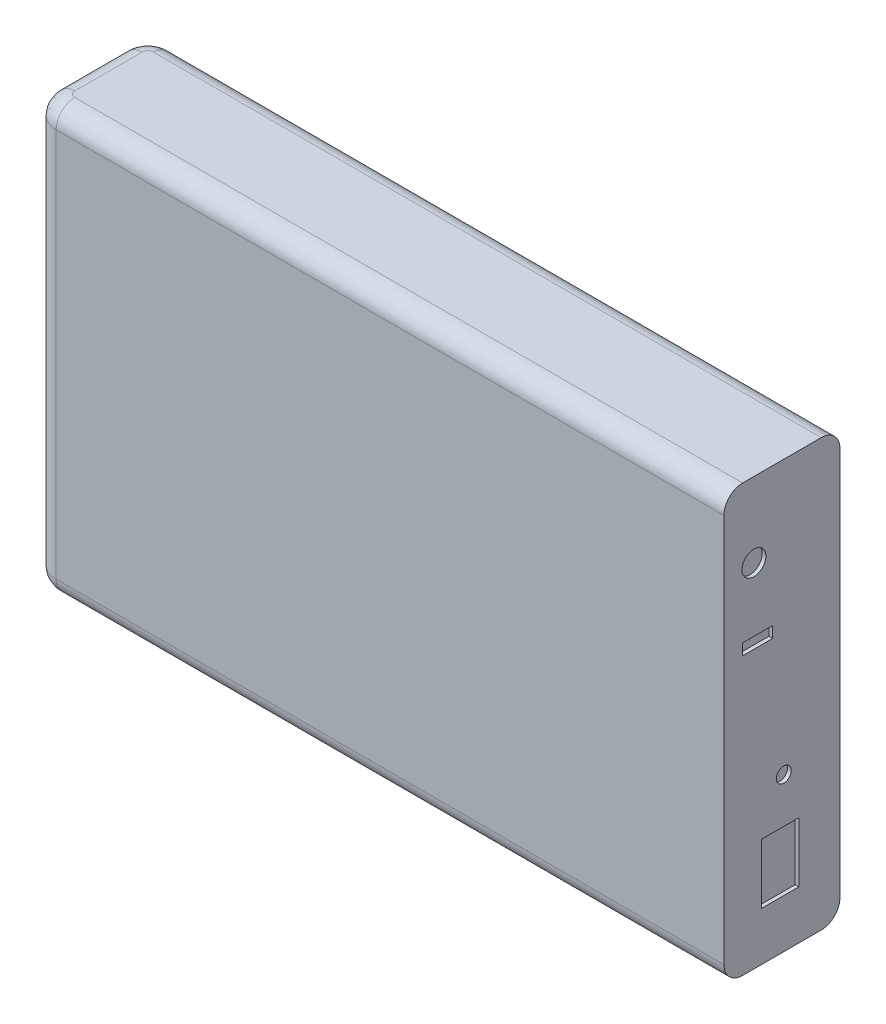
ISO-10303-21;
HEADER;
FILE_DESCRIPTION(('STEP AP214'),'2;1');
FILE_NAME('part.step','',(''),(''),'','','');
FILE_SCHEMA(('AUTOMOTIVE_DESIGN { 1 0 10303 214 1 1 1 1 }'));
ENDSEC;
DATA;
#1=APPLICATION_CONTEXT('core data for automotive mechanical design processes');
#2=APPLICATION_PROTOCOL_DEFINITION('international standard','automotive_design',2000,#1);
#3=PRODUCT_CONTEXT('',#1,'mechanical');
#4=PRODUCT('Part','Part','',(#3));
#5=PRODUCT_RELATED_PRODUCT_CATEGORY('part','',(#4));
#6=PRODUCT_DEFINITION_FORMATION('','',#4);
#7=PRODUCT_DEFINITION_CONTEXT('part definition',#1,'design');
#8=PRODUCT_DEFINITION('design','',#6,#7);
#9=PRODUCT_DEFINITION_SHAPE('','',#8);
#10=(LENGTH_UNIT() NAMED_UNIT(*) SI_UNIT(.MILLI.,.METRE.));
#11=(NAMED_UNIT(*) PLANE_ANGLE_UNIT() SI_UNIT($,.RADIAN.));
#12=(NAMED_UNIT(*) SI_UNIT($,.STERADIAN.) SOLID_ANGLE_UNIT());
#13=UNCERTAINTY_MEASURE_WITH_UNIT(LENGTH_MEASURE(1.E-05),#10,'distance_accuracy_value','');
#14=(GEOMETRIC_REPRESENTATION_CONTEXT(3) GLOBAL_UNCERTAINTY_ASSIGNED_CONTEXT((#13)) GLOBAL_UNIT_ASSIGNED_CONTEXT((#10,
#11,#12)) REPRESENTATION_CONTEXT('',''));
#15=CARTESIAN_POINT('',(0.,0.,0.));
#16=DIRECTION('',(0.,0.,1.));
#17=DIRECTION('',(1.,0.,0.));
#18=AXIS2_PLACEMENT_3D('',#15,#16,#17);
#19=CARTESIAN_POINT('',(-105.845283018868,61.3018867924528,31.));
#20=DIRECTION('',(1.,0.,0.));
#21=DIRECTION('',(0.,1.,0.));
#22=AXIS2_PLACEMENT_3D('',#19,#20,#21);
#23=PLANE('',#22);
#24=CARTESIAN_POINT('',(-105.845283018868,289.301886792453,24.5));
#25=CARTESIAN_POINT('',(-105.845283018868,213.301886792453,24.5));
#26=CARTESIAN_POINT('',(-105.845283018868,137.301886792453,24.5));
#27=CARTESIAN_POINT('',(-105.845283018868,61.3018867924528,24.5));
#28=CARTESIAN_POINT('',(-105.845283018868,23.3018867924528,24.5));
#29=CARTESIAN_POINT('',(-105.845283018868,-14.6981132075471,24.5));
#30=CARTESIAN_POINT('',(-105.845283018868,-52.6981132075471,24.5));
#31=CARTESIAN_POINT('',(-105.845283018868,-128.698113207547,24.5));
#32=CARTESIAN_POINT('',(-105.845283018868,-204.698113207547,24.5));
#33=CARTESIAN_POINT('',(-105.845283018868,-280.698113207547,24.5));
#34=(BOUNDED_CURVE() B_SPLINE_CURVE(3,(#24,#25,#26,#27,#28,#29,#30,#31,#32,#33),.UNSPECIFIED.,
.F.,.F.) B_SPLINE_CURVE_WITH_KNOTS((4,3,3,4),(-0.228,0.,0.114,0.342),
.UNSPECIFIED.) CURVE() GEOMETRIC_REPRESENTATION_ITEM() RATIONAL_B_SPLINE_CURVE((1.,1.,1.,1.,1.,
1.,1.,1.,1.,1.)) REPRESENTATION_ITEM(''));
#35=CARTESIAN_POINT('',(-105.845283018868,-47.6981132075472,24.5));
#36=VERTEX_POINT('',#35);
#37=CARTESIAN_POINT('',(-105.845283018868,56.3018867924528,24.5));
#38=VERTEX_POINT('',#37);
#39=EDGE_CURVE('E271',#36,#38,#34,.F.);
#40=ORIENTED_EDGE('',*,*,#39,.T.);
#41=DIRECTION('',(0.,0.,-1.));
#42=VECTOR('',#41,1.);
#43=CARTESIAN_POINT('',(-105.845283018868,56.3018867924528,31.));
#44=LINE('',#43,#42);
#45=CARTESIAN_POINT('',(-105.845283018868,56.3018867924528,6.5));
#46=VERTEX_POINT('',#45);
#47=EDGE_CURVE('E502',#38,#46,#44,.T.);
#48=ORIENTED_EDGE('',*,*,#47,.T.);
#49=CARTESIAN_POINT('',(-105.845283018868,289.301886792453,6.5));
#50=CARTESIAN_POINT('',(-105.845283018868,213.301886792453,6.5));
#51=CARTESIAN_POINT('',(-105.845283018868,137.301886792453,6.5));
#52=CARTESIAN_POINT('',(-105.845283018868,61.3018867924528,6.5));
#53=CARTESIAN_POINT('',(-105.845283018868,23.3018867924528,6.5));
#54=CARTESIAN_POINT('',(-105.845283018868,-14.6981132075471,6.5));
#55=CARTESIAN_POINT('',(-105.845283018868,-52.6981132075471,6.5));
#56=CARTESIAN_POINT('',(-105.845283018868,-128.698113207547,6.5));
#57=CARTESIAN_POINT('',(-105.845283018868,-204.698113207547,6.5));
#58=CARTESIAN_POINT('',(-105.845283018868,-280.698113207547,6.5));
#59=(BOUNDED_CURVE() B_SPLINE_CURVE(3,(#49,#50,#51,#52,#53,#54,#55,#56,#57,#58),.UNSPECIFIED.,
.F.,.F.) B_SPLINE_CURVE_WITH_KNOTS((4,3,3,4),(-0.228,0.,0.114,0.342),
.UNSPECIFIED.) CURVE() GEOMETRIC_REPRESENTATION_ITEM() RATIONAL_B_SPLINE_CURVE((1.,1.,1.,1.,1.,
1.,1.,1.,1.,1.)) REPRESENTATION_ITEM(''));
#60=CARTESIAN_POINT('',(-105.845283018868,-47.6981132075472,6.5));
#61=VERTEX_POINT('',#60);
#62=EDGE_CURVE('E276',#46,#61,#59,.T.);
#63=ORIENTED_EDGE('',*,*,#62,.T.);
#64=DIRECTION('',(0.,0.,-1.));
#65=VECTOR('',#64,1.);
#66=CARTESIAN_POINT('',(-105.845283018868,-47.6981132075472,31.));
#67=LINE('',#66,#65);
#68=EDGE_CURVE('E500',#61,#36,#67,.F.);
#69=ORIENTED_EDGE('',*,*,#68,.T.);
#70=EDGE_LOOP('',(#40,#48,#63,#69));
#71=FACE_BOUND('',#70,.T.);
#72=ADVANCED_FACE('F37',(#71),#23,.F.);
#73=CARTESIAN_POINT('',(-105.845283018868,-52.6981132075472,31.));
#74=DIRECTION('',(0.,1.,0.));
#75=DIRECTION('',(0.,0.,1.));
#76=AXIS2_PLACEMENT_3D('',#73,#74,#75);
#77=PLANE('',#76);
#78=CARTESIAN_POINT('',(-96.345283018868,-52.6981132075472,5.));
#79=CARTESIAN_POINT('',(-96.345283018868,-52.6981132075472,0.));
#80=CARTESIAN_POINT('',(-96.345283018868,-47.6981132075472,0.));
#81=CARTESIAN_POINT('',(-97.345283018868,-52.6981132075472,5.));
#82=CARTESIAN_POINT('',(-97.345283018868,-52.6981132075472,0.));
#83=CARTESIAN_POINT('',(-97.345283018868,-47.6981132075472,0.));
#84=CARTESIAN_POINT('',(-98.345283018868,-52.6981132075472,5.));
#85=CARTESIAN_POINT('',(-98.345283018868,-52.6981132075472,0.));
#86=CARTESIAN_POINT('',(-98.345283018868,-47.6981132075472,0.));
#87=CARTESIAN_POINT('',(-99.3452830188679,-52.6981132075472,5.));
#88=CARTESIAN_POINT('',(-99.3452830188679,-52.6981132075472,0.));
#89=CARTESIAN_POINT('',(-99.3452830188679,-47.6981132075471,0.));
#90=CARTESIAN_POINT('',(-99.3874729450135,-52.6981132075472,4.99999595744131));
#91=CARTESIAN_POINT('',(-99.528106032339,-52.6981132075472,-1.75177345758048E-05));
#92=CARTESIAN_POINT('',(-99.528106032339,-47.6981132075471,-1.75177345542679E-05));
#93=CARTESIAN_POINT('',(-99.4296609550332,-52.6981132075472,5.00177997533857));
#94=CARTESIAN_POINT('',(-99.7109207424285,-52.6981132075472,0.00771322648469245));
#95=CARTESIAN_POINT('',(-99.7109207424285,-47.6981132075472,0.00771322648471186));
#96=CARTESIAN_POINT('',(-99.513735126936,-52.6981132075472,5.00889284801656));
#97=CARTESIAN_POINT('',(-100.075242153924,-52.6981132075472,0.0385356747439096));
#98=CARTESIAN_POINT('',(-100.075242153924,-47.6981132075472,0.0385356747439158));
#99=CARTESIAN_POINT('',(-99.5556213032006,-52.6981132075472,5.01422153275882));
#100=CARTESIAN_POINT('',(-100.256748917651,-52.6981132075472,0.0616266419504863));
#101=CARTESIAN_POINT('',(-100.256748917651,-47.6981132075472,0.0616266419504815));
#102=CARTESIAN_POINT('',(-99.6387664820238,-52.6981132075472,5.0283871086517));
#103=CARTESIAN_POINT('',(-100.617044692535,-52.6981132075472,0.123010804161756));
#104=CARTESIAN_POINT('',(-100.617044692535,-47.6981132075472,0.123010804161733));
#105=CARTESIAN_POINT('',(-99.6800259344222,-52.6981132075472,5.03722134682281));
#106=CARTESIAN_POINT('',(-100.795835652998,-52.6981132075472,0.16129250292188));
#107=CARTESIAN_POINT('',(-100.795835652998,-47.6981132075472,0.161292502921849));
#108=CARTESIAN_POINT('',(-99.7616439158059,-52.6981132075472,5.0583263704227));
#109=CARTESIAN_POINT('',(-101.149513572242,-52.6981132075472,0.252747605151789));
#110=CARTESIAN_POINT('',(-101.149513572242,-47.6981132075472,0.252747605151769));
#111=CARTESIAN_POINT('',(-99.8020024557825,-52.6981132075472,5.07059711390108));
#112=CARTESIAN_POINT('',(-101.32440057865,-52.6981132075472,0.305920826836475));
#113=CARTESIAN_POINT('',(-101.32440057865,-47.6981132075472,0.305920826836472));
#114=CARTESIAN_POINT('',(-99.9213372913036,-52.6981132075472,5.11246497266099));
#115=CARTESIAN_POINT('',(-101.841518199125,-52.6981132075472,0.487348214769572));
#116=CARTESIAN_POINT('',(-101.841518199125,-47.6981132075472,0.487348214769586));
#117=CARTESIAN_POINT('',(-99.9986066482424,-52.6981132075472,5.14712351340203));
#118=CARTESIAN_POINT('',(-102.176352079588,-52.6981132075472,0.637535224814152));
#119=CARTESIAN_POINT('',(-102.176352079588,-47.6981132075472,0.637535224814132));
#120=CARTESIAN_POINT('',(-100.146173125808,-52.6981132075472,5.22889813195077));
#121=CARTESIAN_POINT('',(-102.815806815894,-52.6981132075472,0.991891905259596));
#122=CARTESIAN_POINT('',(-102.815806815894,-47.6981132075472,0.991891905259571));
#123=CARTESIAN_POINT('',(-100.216471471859,-52.6981132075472,5.27601201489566));
#124=CARTESIAN_POINT('',(-103.120432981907,-52.6981132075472,1.1960520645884));
#125=CARTESIAN_POINT('',(-103.120432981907,-47.6981132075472,1.1960520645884));
#126=CARTESIAN_POINT('',(-100.348172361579,-52.6981132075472,5.38137567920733));
#127=CARTESIAN_POINT('',(-103.691136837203,-52.6981132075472,1.65262794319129));
#128=CARTESIAN_POINT('',(-103.691136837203,-47.6981132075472,1.65262794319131));
#129=CARTESIAN_POINT('',(-100.409574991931,-52.6981132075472,5.43962535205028));
#130=CARTESIAN_POINT('',(-103.957214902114,-52.6981132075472,1.90504319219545));
#131=CARTESIAN_POINT('',(-103.957214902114,-47.6981132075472,1.90504319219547));
#132=CARTESIAN_POINT('',(-100.521738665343,-52.6981132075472,5.56561899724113));
#133=CARTESIAN_POINT('',(-104.443257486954,-52.6981132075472,2.45101565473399));
#134=CARTESIAN_POINT('',(-104.443257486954,-47.6981132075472,2.45101565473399));
#135=CARTESIAN_POINT('',(-100.572497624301,-52.6981132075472,5.63336482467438));
#136=CARTESIAN_POINT('',(-104.663212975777,-52.6981132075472,2.74458090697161));
#137=CARTESIAN_POINT('',(-104.663212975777,-47.6981132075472,2.7445809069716));
#138=CARTESIAN_POINT('',(-100.661929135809,-52.6981132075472,5.77642367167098));
#139=CARTESIAN_POINT('',(-105.050749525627,-52.6981132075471,3.36450257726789));
#140=CARTESIAN_POINT('',(-105.050749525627,-47.6981132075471,3.36450257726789));
#141=CARTESIAN_POINT('',(-100.700599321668,-52.6981132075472,5.85173816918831));
#142=CARTESIAN_POINT('',(-105.218320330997,-52.6981132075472,3.69086539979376));
#143=CARTESIAN_POINT('',(-105.218320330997,-47.6981132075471,3.69086539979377));
#144=CARTESIAN_POINT('',(-100.764726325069,-52.6981132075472,6.00777547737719));
#145=CARTESIAN_POINT('',(-105.496204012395,-52.6981132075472,4.36702706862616));
#146=CARTESIAN_POINT('',(-105.496204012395,-47.6981132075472,4.36702706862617));
#147=CARTESIAN_POINT('',(-100.790190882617,-52.6981132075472,6.08849508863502));
#148=CARTESIAN_POINT('',(-105.606550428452,-52.6981132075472,4.71681205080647));
#149=CARTESIAN_POINT('',(-105.606550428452,-47.6981132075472,4.71681205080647));
#150=CARTESIAN_POINT('',(-100.82085571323,-52.6981132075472,6.22475721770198));
#151=CARTESIAN_POINT('',(-105.739431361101,-52.6981132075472,5.30728127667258));
#152=CARTESIAN_POINT('',(-105.739431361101,-47.6981132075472,5.30728127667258));
#153=CARTESIAN_POINT('',(-100.830010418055,-52.6981132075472,6.27944254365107));
#154=CARTESIAN_POINT('',(-105.779101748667,-52.6981132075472,5.54425102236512));
#155=CARTESIAN_POINT('',(-105.779101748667,-47.6981132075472,5.54425102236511));
#156=CARTESIAN_POINT('',(-100.842223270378,-52.6981132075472,6.38941093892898));
#157=CARTESIAN_POINT('',(-105.832024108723,-52.6981132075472,6.02078073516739));
#158=CARTESIAN_POINT('',(-105.832024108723,-47.6981132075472,6.02078073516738));
#159=CARTESIAN_POINT('',(-100.845290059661,-52.6981132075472,6.44469304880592));
#160=CARTESIAN_POINT('',(-105.845313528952,-52.6981132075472,6.2603365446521));
#161=CARTESIAN_POINT('',(-105.845313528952,-47.6981132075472,6.2603365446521));
#162=CARTESIAN_POINT('',(-100.845283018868,-52.6981132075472,6.5));
#163=CARTESIAN_POINT('',(-105.845283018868,-52.6981132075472,6.49999999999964));
#164=CARTESIAN_POINT('',(-105.845283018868,-47.6981132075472,6.49999999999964));
#165=CARTESIAN_POINT('',(-100.845283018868,-52.6981132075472,7.49999999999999));
#166=CARTESIAN_POINT('',(-105.845283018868,-52.6981132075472,7.49999999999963));
#167=CARTESIAN_POINT('',(-105.845283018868,-47.6981132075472,7.49999999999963));
#168=CARTESIAN_POINT('',(-100.845283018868,-52.6981132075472,8.49999999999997));
#169=CARTESIAN_POINT('',(-105.845283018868,-52.6981132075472,8.49999999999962));
#170=CARTESIAN_POINT('',(-105.845283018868,-47.6981132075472,8.49999999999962));
#171=CARTESIAN_POINT('',(-100.845283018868,-52.6981132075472,9.49999999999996));
#172=CARTESIAN_POINT('',(-105.845283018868,-52.6981132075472,9.49999999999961));
#173=CARTESIAN_POINT('',(-105.845283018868,-47.6981132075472,9.49999999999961));
#174=(BOUNDED_SURFACE() B_SPLINE_SURFACE(3,2,((#78,#79,#80),(#81,#82,#83),(#84,#85,#86),(#87,
#88,#89),(#90,#91,#92),(#93,#94,#95),(#96,#97,#98),(#99,#100,#101),(#102,#103,#104),(#105,#106,
#107),(#108,#109,#110),(#111,#112,#113),(#114,#115,#116),(#117,#118,#119),(#120,#121,#122),
(#123,#124,#125),(#126,#127,#128),(#129,#130,#131),(#132,#133,#134),(#135,#136,#137),(#138,#139,
#140),(#141,#142,#143),(#144,#145,#146),(#147,#148,#149),(#150,#151,#152),(#153,#154,#155),
(#156,#157,#158),(#159,#160,#161),(#162,#163,#164),(#165,#166,#167),(#168,#169,#170),(#171,#172,
#173)),.UNSPECIFIED.,.F.,.F.,.F.) B_SPLINE_SURFACE_WITH_KNOTS((4,3,2,2,2,2,2,2,2,2,2,2,2,3,4),
(3,3),(0.,2.99999999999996,3.12652861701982,3.25305116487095,3.37947814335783,3.50590357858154,
3.75865273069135,4.01135737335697,4.26405955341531,4.51681116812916,4.76961223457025,
5.02226496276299,5.18828832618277,5.35407585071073,8.35407585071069),(0.,1.),
.UNSPECIFIED.) GEOMETRIC_REPRESENTATION_ITEM() RATIONAL_B_SPLINE_SURFACE(((1.,0.707106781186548,
1.),(1.,0.707106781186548,1.),(1.,0.707106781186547,1.),(1.,0.707106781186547,1.),(1.,
0.707106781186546,1.),(1.,0.707106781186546,1.),(1.,0.707106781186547,1.),(1.,0.707106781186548,
1.),(1.,0.707106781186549,1.),(1.,0.70710678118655,1.),(1.,0.707106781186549,1.),(1.,
0.707106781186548,1.),(1.,0.707106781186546,1.),(1.,0.707106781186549,1.),(1.,0.70710678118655,
1.),(1.,0.707106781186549,1.),(1.,0.707106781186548,1.),(1.,0.707106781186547,1.),(1.,
0.707106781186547,1.),(1.,0.707106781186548,1.),(1.,0.707106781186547,1.),(1.,0.707106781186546,
1.),(1.,0.707106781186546,1.),(1.,0.707106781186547,1.),(1.,0.707106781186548,1.),(1.,
0.707106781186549,1.),(1.,0.707106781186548,1.),(1.,0.707106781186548,1.),(1.,0.707106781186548,
1.),(1.,0.707106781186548,1.),(1.,0.707106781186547,1.),(1.,0.707106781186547,1.))) REPRESENTATION_ITEM('') SURFACE());
#175=CARTESIAN_POINT('',(-100.845283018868,-52.6981132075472,9.49999999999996));
#176=CARTESIAN_POINT('',(-100.845283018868,-52.6981132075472,8.49999999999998));
#177=CARTESIAN_POINT('',(-100.845283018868,-52.6981132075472,7.49999999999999));
#178=CARTESIAN_POINT('',(-100.845283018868,-52.6981132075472,6.5));
#179=CARTESIAN_POINT('',(-100.845290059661,-52.6981132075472,6.44469304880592));
#180=CARTESIAN_POINT('',(-100.842223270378,-52.6981132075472,6.38941093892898));
#181=CARTESIAN_POINT('',(-100.830010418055,-52.6981132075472,6.27944254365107));
#182=CARTESIAN_POINT('',(-100.82085571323,-52.6981132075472,6.22475721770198));
#183=CARTESIAN_POINT('',(-100.790190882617,-52.6981132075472,6.08849508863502));
#184=CARTESIAN_POINT('',(-100.764726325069,-52.6981132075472,6.00777547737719));
#185=CARTESIAN_POINT('',(-100.700599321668,-52.6981132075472,5.85173816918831));
#186=CARTESIAN_POINT('',(-100.661929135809,-52.6981132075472,5.77642367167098));
#187=CARTESIAN_POINT('',(-100.572497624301,-52.6981132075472,5.63336482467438));
#188=CARTESIAN_POINT('',(-100.521738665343,-52.6981132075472,5.56561899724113));
#189=CARTESIAN_POINT('',(-100.409574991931,-52.6981132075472,5.43962535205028));
#190=CARTESIAN_POINT('',(-100.348172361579,-52.6981132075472,5.38137567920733));
#191=CARTESIAN_POINT('',(-100.216471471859,-52.6981132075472,5.27601201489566));
#192=CARTESIAN_POINT('',(-100.146173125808,-52.6981132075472,5.22889813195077));
#193=CARTESIAN_POINT('',(-99.9986066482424,-52.6981132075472,5.14712351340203));
#194=CARTESIAN_POINT('',(-99.9213372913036,-52.6981132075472,5.11246497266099));
#195=CARTESIAN_POINT('',(-99.8020024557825,-52.6981132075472,5.07059711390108));
#196=CARTESIAN_POINT('',(-99.7616439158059,-52.6981132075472,5.05832637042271));
#197=CARTESIAN_POINT('',(-99.6800259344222,-52.6981132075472,5.03722134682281));
#198=CARTESIAN_POINT('',(-99.6387664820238,-52.6981132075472,5.0283871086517));
#199=CARTESIAN_POINT('',(-99.5556213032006,-52.6981132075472,5.01422153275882));
#200=CARTESIAN_POINT('',(-99.513735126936,-52.6981132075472,5.00889284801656));
#201=CARTESIAN_POINT('',(-99.4296609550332,-52.6981132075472,5.00177997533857));
#202=CARTESIAN_POINT('',(-99.3874729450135,-52.6981132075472,4.99999595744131));
#203=CARTESIAN_POINT('',(-99.3452830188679,-52.6981132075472,5.));
#204=CARTESIAN_POINT('',(-98.345283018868,-52.6981132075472,5.));
#205=CARTESIAN_POINT('',(-97.345283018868,-52.6981132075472,5.));
#206=CARTESIAN_POINT('',(-96.345283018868,-52.6981132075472,5.));
#207=B_SPLINE_CURVE_WITH_KNOTS('',3,(#175,#176,#177,#178,#179,#180,#181,#182,#183,#184,#185,
#186,#187,#188,#189,#190,#191,#192,#193,#194,#195,#196,#197,#198,#199,#200,#201,#202,#203,#204,
#205,#206),.UNSPECIFIED.,.F.,.F.,(4,3,2,2,2,2,2,2,2,2,2,2,2,3,4),(0.,2.99999999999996,
3.16578752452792,3.3318108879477,3.58446361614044,3.83726468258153,4.09001629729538,
4.34271847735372,4.59542312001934,4.84817227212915,4.97459770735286,5.10102468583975,
5.22754723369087,5.35407585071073,8.35407585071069),.UNSPECIFIED.);
#208=CARTESIAN_POINT('',(-100.845283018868,-52.6981132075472,6.5));
#209=VERTEX_POINT('',#208);
#210=CARTESIAN_POINT('',(-99.3452830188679,-52.6981132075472,5.));
#211=VERTEX_POINT('',#210);
#212=EDGE_CURVE('E437',#209,#211,#207,.T.);
#213=ORIENTED_EDGE('',*,*,#212,.T.);
#214=DIRECTION('',(1.,0.,0.));
#215=VECTOR('',#214,1.);
#216=CARTESIAN_POINT('',(-105.845283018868,-52.6981132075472,5.));
#217=LINE('',#216,#215);
#218=CARTESIAN_POINT('',(79.1547169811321,-52.6981132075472,5.));
#219=VERTEX_POINT('',#218);
#220=EDGE_CURVE('E442',#211,#219,#217,.T.);
#221=ORIENTED_EDGE('',*,*,#220,.T.);
#222=DIRECTION('',(0.,0.,-1.));
#223=VECTOR('',#222,1.);
#224=CARTESIAN_POINT('',(79.1547169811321,-52.6981132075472,31.));
#225=LINE('',#224,#223);
#226=CARTESIAN_POINT('',(79.1547169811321,-52.6981132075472,26.));
#227=VERTEX_POINT('',#226);
#228=EDGE_CURVE('E268',#227,#219,#225,.T.);
#229=ORIENTED_EDGE('',*,*,#228,.F.);
#230=DIRECTION('',(1.,0.,0.));
#231=VECTOR('',#230,1.);
#232=CARTESIAN_POINT('',(-99.3452830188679,-52.6981132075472,26.));
#233=LINE('',#232,#231);
#234=CARTESIAN_POINT('',(-99.3452830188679,-52.6981132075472,26.));
#235=VERTEX_POINT('',#234);
#236=EDGE_CURVE('E434',#227,#235,#233,.F.);
#237=ORIENTED_EDGE('',*,*,#236,.T.);
#238=CARTESIAN_POINT('',(-100.845283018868,-52.6981132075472,21.5));
#239=CARTESIAN_POINT('',(-105.845283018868,-52.6981132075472,21.5));
#240=CARTESIAN_POINT('',(-105.845283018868,-47.6981132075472,21.5));
#241=CARTESIAN_POINT('',(-100.845283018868,-52.6981132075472,22.5));
#242=CARTESIAN_POINT('',(-105.845283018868,-52.6981132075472,22.5));
#243=CARTESIAN_POINT('',(-105.845283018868,-47.6981132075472,22.5));
#244=CARTESIAN_POINT('',(-100.845283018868,-52.6981132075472,23.5));
#245=CARTESIAN_POINT('',(-105.845283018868,-52.6981132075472,23.5));
#246=CARTESIAN_POINT('',(-105.845283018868,-47.6981132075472,23.5));
#247=CARTESIAN_POINT('',(-100.845283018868,-52.6981132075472,24.5));
#248=CARTESIAN_POINT('',(-105.845283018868,-52.6981132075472,24.5));
#249=CARTESIAN_POINT('',(-105.845283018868,-47.6981132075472,24.5));
#250=CARTESIAN_POINT('',(-100.845287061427,-52.6981132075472,24.5421899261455));
#251=CARTESIAN_POINT('',(-105.845300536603,-52.6981132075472,24.682823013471));
#252=CARTESIAN_POINT('',(-105.845300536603,-47.6981132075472,24.682823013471));
#253=CARTESIAN_POINT('',(-100.843503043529,-52.6981132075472,24.5843779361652));
#254=CARTESIAN_POINT('',(-105.837569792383,-52.6981132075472,24.8656377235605));
#255=CARTESIAN_POINT('',(-105.837569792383,-47.6981132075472,24.8656377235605));
#256=CARTESIAN_POINT('',(-100.836390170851,-52.6981132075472,24.668452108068));
#257=CARTESIAN_POINT('',(-105.806747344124,-52.6981132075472,25.2299591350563));
#258=CARTESIAN_POINT('',(-105.806747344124,-47.6981132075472,25.2299591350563));
#259=CARTESIAN_POINT('',(-100.831061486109,-52.6981132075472,24.7103382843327));
#260=CARTESIAN_POINT('',(-105.783656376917,-52.6981132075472,25.411465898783));
#261=CARTESIAN_POINT('',(-105.783656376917,-47.6981132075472,25.411465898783));
#262=CARTESIAN_POINT('',(-100.816895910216,-52.6981132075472,24.7934834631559));
#263=CARTESIAN_POINT('',(-105.722272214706,-52.6981132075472,25.771761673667));
#264=CARTESIAN_POINT('',(-105.722272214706,-47.6981132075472,25.771761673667));
#265=CARTESIAN_POINT('',(-100.808061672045,-52.6981132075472,24.8347429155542));
#266=CARTESIAN_POINT('',(-105.683990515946,-52.6981132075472,25.9505526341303));
#267=CARTESIAN_POINT('',(-105.683990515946,-47.6981132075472,25.9505526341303));
#268=CARTESIAN_POINT('',(-100.786956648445,-52.6981132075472,24.916360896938));
#269=CARTESIAN_POINT('',(-105.592535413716,-52.6981132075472,26.3042305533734));
#270=CARTESIAN_POINT('',(-105.592535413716,-47.6981132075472,26.3042305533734));
#271=CARTESIAN_POINT('',(-100.774685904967,-52.6981132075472,24.9567194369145));
#272=CARTESIAN_POINT('',(-105.539362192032,-52.6981132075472,26.4791175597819));
#273=CARTESIAN_POINT('',(-105.539362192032,-47.6981132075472,26.4791175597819));
#274=CARTESIAN_POINT('',(-100.732818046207,-52.6981132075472,25.0760542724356));
#275=CARTESIAN_POINT('',(-105.357934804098,-52.6981132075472,26.9962351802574));
#276=CARTESIAN_POINT('',(-105.357934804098,-47.6981132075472,26.9962351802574));
#277=CARTESIAN_POINT('',(-100.698159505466,-52.6981132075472,25.1533236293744));
#278=CARTESIAN_POINT('',(-105.207747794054,-52.6981132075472,27.3310690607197));
#279=CARTESIAN_POINT('',(-105.207747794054,-47.6981132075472,27.3310690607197));
#280=CARTESIAN_POINT('',(-100.616384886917,-52.6981132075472,25.3008901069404));
#281=CARTESIAN_POINT('',(-104.853391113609,-52.6981132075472,27.9705237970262));
#282=CARTESIAN_POINT('',(-104.853391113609,-47.6981132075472,27.9705237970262));
#283=CARTESIAN_POINT('',(-100.569271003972,-52.6981132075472,25.3711884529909));
#284=CARTESIAN_POINT('',(-104.64923095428,-52.6981132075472,28.2751499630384));
#285=CARTESIAN_POINT('',(-104.64923095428,-47.6981132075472,28.2751499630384));
#286=CARTESIAN_POINT('',(-100.463907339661,-52.6981132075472,25.5028893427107));
#287=CARTESIAN_POINT('',(-104.192655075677,-52.6981132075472,28.8458538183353));
#288=CARTESIAN_POINT('',(-104.192655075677,-47.6981132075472,28.8458538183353));
#289=CARTESIAN_POINT('',(-100.405657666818,-52.6981132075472,25.5642919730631));
#290=CARTESIAN_POINT('',(-103.940239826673,-52.6981132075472,29.111931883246));
#291=CARTESIAN_POINT('',(-103.940239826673,-47.6981132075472,29.1119318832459));
#292=CARTESIAN_POINT('',(-100.279664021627,-52.6981132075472,25.676455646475));
#293=CARTESIAN_POINT('',(-103.394267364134,-52.6981132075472,29.5979744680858));
#294=CARTESIAN_POINT('',(-103.394267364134,-47.6981132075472,29.5979744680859));
#295=CARTESIAN_POINT('',(-100.211918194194,-52.6981132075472,25.7272146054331));
#296=CARTESIAN_POINT('',(-103.100702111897,-52.6981132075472,29.8179299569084));
#297=CARTESIAN_POINT('',(-103.100702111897,-47.6981132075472,29.8179299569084));
#298=CARTESIAN_POINT('',(-100.068859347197,-52.6981132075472,25.8166461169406));
#299=CARTESIAN_POINT('',(-102.4807804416,-52.6981132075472,30.2054665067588));
#300=CARTESIAN_POINT('',(-102.4807804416,-47.6981132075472,30.2054665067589));
#301=CARTESIAN_POINT('',(-99.9935448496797,-52.6981132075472,25.8553163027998));
#302=CARTESIAN_POINT('',(-102.154417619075,-52.6981132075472,30.373037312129));
#303=CARTESIAN_POINT('',(-102.154417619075,-47.6981132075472,30.373037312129));
#304=CARTESIAN_POINT('',(-99.8375075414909,-52.6981132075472,25.9194433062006));
#305=CARTESIAN_POINT('',(-101.478255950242,-52.6981132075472,30.6509209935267));
#306=CARTESIAN_POINT('',(-101.478255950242,-47.6981132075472,30.6509209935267));
#307=CARTESIAN_POINT('',(-99.756787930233,-52.6981132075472,25.9449078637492));
#308=CARTESIAN_POINT('',(-101.128470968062,-52.6981132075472,30.7612674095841));
#309=CARTESIAN_POINT('',(-101.128470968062,-47.6981132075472,30.7612674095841));
#310=CARTESIAN_POINT('',(-99.620525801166,-52.6981132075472,25.975572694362));
#311=CARTESIAN_POINT('',(-100.538001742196,-52.6981132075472,30.8941483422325));
#312=CARTESIAN_POINT('',(-100.538001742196,-47.6981132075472,30.8941483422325));
#313=CARTESIAN_POINT('',(-99.5658404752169,-52.6981132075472,25.9847273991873));
#314=CARTESIAN_POINT('',(-100.301031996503,-52.6981132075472,30.9338187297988));
#315=CARTESIAN_POINT('',(-100.301031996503,-47.6981132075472,30.9338187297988));
#316=CARTESIAN_POINT('',(-99.455872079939,-52.6981132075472,25.9969402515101));
#317=CARTESIAN_POINT('',(-99.8245022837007,-52.6981132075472,30.9867410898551));
#318=CARTESIAN_POINT('',(-99.8245022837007,-47.6981132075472,30.9867410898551));
#319=CARTESIAN_POINT('',(-99.400589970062,-52.6981132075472,26.0000070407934));
#320=CARTESIAN_POINT('',(-99.584946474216,-52.6981132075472,31.0000305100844));
#321=CARTESIAN_POINT('',(-99.584946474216,-47.6981132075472,31.0000305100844));
#322=CARTESIAN_POINT('',(-99.3452830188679,-52.6981132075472,26.));
#323=CARTESIAN_POINT('',(-99.3452830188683,-52.6981132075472,31.));
#324=CARTESIAN_POINT('',(-99.3452830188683,-47.6981132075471,31.));
#325=CARTESIAN_POINT('',(-98.3452830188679,-52.6981132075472,26.));
#326=CARTESIAN_POINT('',(-98.3452830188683,-52.6981132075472,31.));
#327=CARTESIAN_POINT('',(-98.3452830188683,-47.6981132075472,31.));
#328=CARTESIAN_POINT('',(-97.345283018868,-52.6981132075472,26.));
#329=CARTESIAN_POINT('',(-97.3452830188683,-52.6981132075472,31.));
#330=CARTESIAN_POINT('',(-97.3452830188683,-47.6981132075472,31.));
#331=CARTESIAN_POINT('',(-96.345283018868,-52.6981132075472,26.));
#332=CARTESIAN_POINT('',(-96.3452830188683,-52.6981132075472,31.));
#333=CARTESIAN_POINT('',(-96.3452830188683,-47.6981132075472,31.));
#334=(BOUNDED_SURFACE() B_SPLINE_SURFACE(3,2,((#238,#239,#240),(#241,#242,#243),(#244,#245,
#246),(#247,#248,#249),(#250,#251,#252),(#253,#254,#255),(#256,#257,#258),(#259,#260,#261),
(#262,#263,#264),(#265,#266,#267),(#268,#269,#270),(#271,#272,#273),(#274,#275,#276),(#277,#278,
#279),(#280,#281,#282),(#283,#284,#285),(#286,#287,#288),(#289,#290,#291),(#292,#293,#294),
(#295,#296,#297),(#298,#299,#300),(#301,#302,#303),(#304,#305,#306),(#307,#308,#309),(#310,#311,
#312),(#313,#314,#315),(#316,#317,#318),(#319,#320,#321),(#322,#323,#324),(#325,#326,#327),
(#328,#329,#330),(#331,#332,#333)),.UNSPECIFIED.,.F.,.F.,.F.) B_SPLINE_SURFACE_WITH_KNOTS((4,3,
2,2,2,2,2,2,2,2,2,2,2,3,4),(3,3),(0.,2.99999999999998,3.12652861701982,3.25305116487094,
3.3794781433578,3.50590357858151,3.7586527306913,4.0113573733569,4.26405955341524,
4.51681116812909,4.76961223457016,5.02226496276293,5.18828832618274,5.35407585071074,
8.35407585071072),(0.,1.),
.UNSPECIFIED.) GEOMETRIC_REPRESENTATION_ITEM() RATIONAL_B_SPLINE_SURFACE(((1.,0.707106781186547,
1.),(1.,0.707106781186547,1.),(1.,0.707106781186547,1.),(1.,0.707106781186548,1.),(1.,
0.707106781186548,1.),(1.,0.707106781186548,1.),(1.,0.707106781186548,1.),(1.,0.707106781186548,
1.),(1.,0.707106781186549,1.),(1.,0.707106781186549,1.),(1.,0.707106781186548,1.),(1.,
0.707106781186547,1.),(1.,0.707106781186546,1.),(1.,0.707106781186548,1.),(1.,0.707106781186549,
1.),(1.,0.707106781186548,1.),(1.,0.707106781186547,1.),(1.,0.707106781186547,1.),(1.,
0.707106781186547,1.),(1.,0.707106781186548,1.),(1.,0.707106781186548,1.),(1.,0.707106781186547,
1.),(1.,0.707106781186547,1.),(1.,0.707106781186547,1.),(1.,0.707106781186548,1.),(1.,
0.707106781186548,1.),(1.,0.707106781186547,1.),(1.,0.707106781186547,1.),(1.,0.707106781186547,
1.),(1.,0.707106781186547,1.),(1.,0.707106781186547,1.),(1.,0.707106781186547,1.))) REPRESENTATION_ITEM('') SURFACE());
#335=CARTESIAN_POINT('',(-96.345283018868,-52.6981132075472,26.));
#336=CARTESIAN_POINT('',(-97.345283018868,-52.6981132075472,26.));
#337=CARTESIAN_POINT('',(-98.345283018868,-52.6981132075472,26.));
#338=CARTESIAN_POINT('',(-99.3452830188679,-52.6981132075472,26.));
#339=CARTESIAN_POINT('',(-99.400589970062,-52.6981132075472,26.0000070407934));
#340=CARTESIAN_POINT('',(-99.455872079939,-52.6981132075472,25.9969402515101));
#341=CARTESIAN_POINT('',(-99.5658404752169,-52.6981132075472,25.9847273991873));
#342=CARTESIAN_POINT('',(-99.620525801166,-52.6981132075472,25.975572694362));
#343=CARTESIAN_POINT('',(-99.756787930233,-52.6981132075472,25.9449078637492));
#344=CARTESIAN_POINT('',(-99.8375075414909,-52.6981132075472,25.9194433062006));
#345=CARTESIAN_POINT('',(-99.9935448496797,-52.6981132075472,25.8553163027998));
#346=CARTESIAN_POINT('',(-100.068859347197,-52.6981132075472,25.8166461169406));
#347=CARTESIAN_POINT('',(-100.211918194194,-52.6981132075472,25.7272146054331));
#348=CARTESIAN_POINT('',(-100.279664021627,-52.6981132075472,25.676455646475));
#349=CARTESIAN_POINT('',(-100.405657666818,-52.6981132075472,25.5642919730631));
#350=CARTESIAN_POINT('',(-100.463907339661,-52.6981132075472,25.5028893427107));
#351=CARTESIAN_POINT('',(-100.569271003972,-52.6981132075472,25.3711884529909));
#352=CARTESIAN_POINT('',(-100.616384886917,-52.6981132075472,25.3008901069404));
#353=CARTESIAN_POINT('',(-100.698159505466,-52.6981132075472,25.1533236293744));
#354=CARTESIAN_POINT('',(-100.732818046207,-52.6981132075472,25.0760542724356));
#355=CARTESIAN_POINT('',(-100.774685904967,-52.6981132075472,24.9567194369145));
#356=CARTESIAN_POINT('',(-100.786956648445,-52.6981132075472,24.916360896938));
#357=CARTESIAN_POINT('',(-100.808061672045,-52.6981132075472,24.8347429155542));
#358=CARTESIAN_POINT('',(-100.816895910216,-52.6981132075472,24.7934834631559));
#359=CARTESIAN_POINT('',(-100.831061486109,-52.6981132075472,24.7103382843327));
#360=CARTESIAN_POINT('',(-100.836390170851,-52.6981132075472,24.668452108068));
#361=CARTESIAN_POINT('',(-100.843503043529,-52.6981132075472,24.5843779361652));
#362=CARTESIAN_POINT('',(-100.845287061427,-52.6981132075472,24.5421899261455));
#363=CARTESIAN_POINT('',(-100.845283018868,-52.6981132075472,24.5));
#364=CARTESIAN_POINT('',(-100.845283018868,-52.6981132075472,23.5));
#365=CARTESIAN_POINT('',(-100.845283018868,-52.6981132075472,22.5));
#366=CARTESIAN_POINT('',(-100.845283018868,-52.6981132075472,21.5));
#367=B_SPLINE_CURVE_WITH_KNOTS('',3,(#335,#336,#337,#338,#339,#340,#341,#342,#343,#344,#345,
#346,#347,#348,#349,#350,#351,#352,#353,#354,#355,#356,#357,#358,#359,#360,#361,#362,#363,#364,
#365,#366),.UNSPECIFIED.,.F.,.F.,(4,3,2,2,2,2,2,2,2,2,2,2,2,3,4),(0.,2.99999999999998,
3.16578752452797,3.33181088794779,3.58446361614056,3.83726468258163,4.09001629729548,
4.34271847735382,4.59542312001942,4.84817227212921,4.97459770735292,5.10102468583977,
5.22754723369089,5.35407585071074,8.35407585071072),.UNSPECIFIED.);
#368=CARTESIAN_POINT('',(-100.845283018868,-52.6981132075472,24.5));
#369=VERTEX_POINT('',#368);
#370=EDGE_CURVE('E427',#235,#369,#367,.T.);
#371=ORIENTED_EDGE('',*,*,#370,.T.);
#372=DIRECTION('',(0.,0.,-1.));
#373=VECTOR('',#372,1.);
#374=CARTESIAN_POINT('',(-100.845283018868,-52.6981132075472,31.));
#375=LINE('',#374,#373);
#376=EDGE_CURVE('E433',#369,#209,#375,.T.);
#377=ORIENTED_EDGE('',*,*,#376,.T.);
#378=EDGE_LOOP('',(#213,#221,#229,#237,#371,#377));
#379=FACE_BOUND('',#378,.T.);
#380=ADVANCED_FACE('F391',(#379),#77,.F.);
#381=CARTESIAN_POINT('',(79.1547169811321,61.3018867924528,31.));
#382=DIRECTION('',(-1.,0.,0.));
#383=DIRECTION('',(0.,0.,1.));
#384=AXIS2_PLACEMENT_3D('',#381,#382,#383);
#385=PLANE('',#384);
#386=CARTESIAN_POINT('',(79.1547169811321,-11.6981132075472,15.));
#387=DIRECTION('',(1.,0.,0.));
#388=DIRECTION('',(0.,0.,-1.));
#389=AXIS2_PLACEMENT_3D('',#386,#387,#388);
#390=CIRCLE('',#389,2.);
#391=CARTESIAN_POINT('',(79.1547169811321,-11.6981132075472,13.));
#392=VERTEX_POINT('',#391);
#393=EDGE_CURVE('E205',#392,#392,#390,.T.);
#394=ORIENTED_EDGE('',*,*,#393,.F.);
#395=EDGE_LOOP('',(#394));
#396=FACE_BOUND('',#395,.T.);
#397=DIRECTION('',(0.,0.,-1.));
#398=VECTOR('',#397,1.);
#399=CARTESIAN_POINT('',(79.1547169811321,21.3018867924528,26.));
#400=LINE('',#399,#398);
#401=CARTESIAN_POINT('',(79.1547169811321,21.3018867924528,26.));
#402=VERTEX_POINT('',#401);
#403=CARTESIAN_POINT('',(79.1547169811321,21.3018867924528,18.));
#404=VERTEX_POINT('',#403);
#405=EDGE_CURVE('E211',#402,#404,#400,.T.);
#406=ORIENTED_EDGE('',*,*,#405,.F.);
#407=DIRECTION('',(0.,-1.,0.));
#408=VECTOR('',#407,1.);
#409=CARTESIAN_POINT('',(79.1547169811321,21.3018867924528,26.));
#410=LINE('',#409,#408);
#411=CARTESIAN_POINT('',(79.1547169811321,24.3018867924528,26.));
#412=VERTEX_POINT('',#411);
#413=EDGE_CURVE('E58',#412,#402,#410,.T.);
#414=ORIENTED_EDGE('',*,*,#413,.F.);
#415=DIRECTION('',(0.,0.,1.));
#416=VECTOR('',#415,1.);
#417=CARTESIAN_POINT('',(79.1547169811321,24.3018867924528,26.));
#418=LINE('',#417,#416);
#419=CARTESIAN_POINT('',(79.1547169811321,24.3018867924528,18.));
#420=VERTEX_POINT('',#419);
#421=EDGE_CURVE('E199',#420,#412,#418,.T.);
#422=ORIENTED_EDGE('',*,*,#421,.F.);
#423=DIRECTION('',(0.,1.,0.));
#424=VECTOR('',#423,1.);
#425=CARTESIAN_POINT('',(79.1547169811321,21.3018867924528,18.));
#426=LINE('',#425,#424);
#427=EDGE_CURVE('E202',#404,#420,#426,.T.);
#428=ORIENTED_EDGE('',*,*,#427,.F.);
#429=EDGE_LOOP('',(#406,#414,#422,#428));
#430=FACE_BOUND('',#429,.T.);
#431=CARTESIAN_POINT('',(79.1547169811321,41.3018867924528,23.));
#432=DIRECTION('',(1.,0.,0.));
#433=DIRECTION('',(0.,0.,-1.));
#434=AXIS2_PLACEMENT_3D('',#431,#432,#433);
#435=CIRCLE('',#434,3.2);
#436=CARTESIAN_POINT('',(79.1547169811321,41.3018867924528,19.8));
#437=VERTEX_POINT('',#436);
#438=EDGE_CURVE('E223',#437,#437,#435,.T.);
#439=ORIENTED_EDGE('',*,*,#438,.F.);
#440=EDGE_LOOP('',(#439));
#441=FACE_BOUND('',#440,.T.);
#442=DIRECTION('',(0.,0.,-1.));
#443=VECTOR('',#442,1.);
#444=CARTESIAN_POINT('',(79.1547169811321,-39.6981132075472,21.));
#445=LINE('',#444,#443);
#446=CARTESIAN_POINT('',(79.1547169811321,-39.6981132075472,21.));
#447=VERTEX_POINT('',#446);
#448=CARTESIAN_POINT('',(79.1547169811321,-39.6981132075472,11.));
#449=VERTEX_POINT('',#448);
#450=EDGE_CURVE('E241',#447,#449,#445,.T.);
#451=ORIENTED_EDGE('',*,*,#450,.F.);
#452=DIRECTION('',(0.,-1.,0.));
#453=VECTOR('',#452,1.);
#454=CARTESIAN_POINT('',(79.1547169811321,-39.6981132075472,21.));
#455=LINE('',#454,#453);
#456=CARTESIAN_POINT('',(79.1547169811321,-23.6981132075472,21.));
#457=VERTEX_POINT('',#456);
#458=EDGE_CURVE('E66',#457,#447,#455,.T.);
#459=ORIENTED_EDGE('',*,*,#458,.F.);
#460=DIRECTION('',(0.,0.,1.));
#461=VECTOR('',#460,1.);
#462=CARTESIAN_POINT('',(79.1547169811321,-23.6981132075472,21.));
#463=LINE('',#462,#461);
#464=CARTESIAN_POINT('',(79.1547169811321,-23.6981132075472,11.));
#465=VERTEX_POINT('',#464);
#466=EDGE_CURVE('E230',#465,#457,#463,.T.);
#467=ORIENTED_EDGE('',*,*,#466,.F.);
#468=DIRECTION('',(0.,1.,0.));
#469=VECTOR('',#468,1.);
#470=CARTESIAN_POINT('',(79.1547169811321,-39.6981132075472,11.));
#471=LINE('',#470,#469);
#472=EDGE_CURVE('E245',#449,#465,#471,.T.);
#473=ORIENTED_EDGE('',*,*,#472,.F.);
#474=EDGE_LOOP('',(#451,#459,#467,#473));
#475=FACE_BOUND('',#474,.T.);
#476=DIRECTION('',(0.,1.,0.));
#477=VECTOR('',#476,1.);
#478=CARTESIAN_POINT('',(79.1547169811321,61.3018867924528,0.));
#479=LINE('',#478,#477);
#480=CARTESIAN_POINT('',(79.1547169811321,-47.6981132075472,0.));
#481=VERTEX_POINT('',#480);
#482=CARTESIAN_POINT('',(79.1547169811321,56.3018867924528,0.));
#483=VERTEX_POINT('',#482);
#484=EDGE_CURVE('E262',#481,#483,#479,.T.);
#485=ORIENTED_EDGE('',*,*,#484,.T.);
#486=CARTESIAN_POINT('',(79.1547169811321,56.3018867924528,5.));
#487=DIRECTION('',(-1.,0.,0.));
#488=DIRECTION('',(0.,0.,1.));
#489=AXIS2_PLACEMENT_3D('',#486,#487,#488);
#490=CIRCLE('',#489,5.);
#491=CARTESIAN_POINT('',(79.1547169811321,61.3018867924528,5.));
#492=VERTEX_POINT('',#491);
#493=EDGE_CURVE('E478',#483,#492,#490,.F.);
#494=ORIENTED_EDGE('',*,*,#493,.T.);
#495=DIRECTION('',(0.,0.,-1.));
#496=VECTOR('',#495,1.);
#497=CARTESIAN_POINT('',(79.1547169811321,61.3018867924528,31.));
#498=LINE('',#497,#496);
#499=CARTESIAN_POINT('',(79.1547169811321,61.3018867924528,26.));
#500=VERTEX_POINT('',#499);
#501=EDGE_CURVE('E261',#500,#492,#498,.T.);
#502=ORIENTED_EDGE('',*,*,#501,.F.);
#503=CARTESIAN_POINT('',(79.1547169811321,56.3018867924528,26.));
#504=DIRECTION('',(-1.,0.,0.));
#505=DIRECTION('',(0.,0.,1.));
#506=AXIS2_PLACEMENT_3D('',#503,#504,#505);
#507=CIRCLE('',#506,5.);
#508=CARTESIAN_POINT('',(79.1547169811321,56.3018867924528,31.));
#509=VERTEX_POINT('',#508);
#510=EDGE_CURVE('E471',#500,#509,#507,.F.);
#511=ORIENTED_EDGE('',*,*,#510,.T.);
#512=DIRECTION('',(0.,1.,0.));
#513=VECTOR('',#512,1.);
#514=CARTESIAN_POINT('',(79.1547169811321,61.3018867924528,31.));
#515=LINE('',#514,#513);
#516=CARTESIAN_POINT('',(79.1547169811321,-47.6981132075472,31.));
#517=VERTEX_POINT('',#516);
#518=EDGE_CURVE('E258',#517,#509,#515,.T.);
#519=ORIENTED_EDGE('',*,*,#518,.F.);
#520=CARTESIAN_POINT('',(79.1547169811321,-47.6981132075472,26.));
#521=DIRECTION('',(-1.,0.,0.));
#522=DIRECTION('',(0.,0.,1.));
#523=AXIS2_PLACEMENT_3D('',#520,#521,#522);
#524=CIRCLE('',#523,5.);
#525=EDGE_CURVE('E541',#517,#227,#524,.F.);
#526=ORIENTED_EDGE('',*,*,#525,.T.);
#527=ORIENTED_EDGE('',*,*,#228,.T.);
#528=CARTESIAN_POINT('',(79.1547169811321,-47.6981132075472,5.));
#529=DIRECTION('',(-1.,0.,0.));
#530=DIRECTION('',(0.,0.,1.));
#531=AXIS2_PLACEMENT_3D('',#528,#529,#530);
#532=CIRCLE('',#531,5.);
#533=EDGE_CURVE('E483',#219,#481,#532,.F.);
#534=ORIENTED_EDGE('',*,*,#533,.T.);
#535=EDGE_LOOP('',(#485,#494,#502,#511,#519,#526,#527,#534));
#536=FACE_BOUND('',#535,.T.);
#537=ADVANCED_FACE('F324',(#396,#430,#441,#475,#536),#385,.F.);
#538=CARTESIAN_POINT('',(-105.845283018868,61.3018867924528,31.));
#539=DIRECTION('',(0.,-1.,0.));
#540=DIRECTION('',(0.,0.,-1.));
#541=AXIS2_PLACEMENT_3D('',#538,#539,#540);
#542=PLANE('',#541);
#543=ORIENTED_EDGE('',*,*,#501,.T.);
#544=DIRECTION('',(-1.,0.,0.));
#545=VECTOR('',#544,1.);
#546=CARTESIAN_POINT('',(-105.845283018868,61.3018867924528,5.));
#547=LINE('',#546,#545);
#548=CARTESIAN_POINT('',(-99.3452830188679,61.3018867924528,5.));
#549=VERTEX_POINT('',#548);
#550=EDGE_CURVE('E544',#492,#549,#547,.T.);
#551=ORIENTED_EDGE('',*,*,#550,.T.);
#552=CARTESIAN_POINT('',(-100.845283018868,61.3018867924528,9.49999999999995));
#553=CARTESIAN_POINT('',(-105.845283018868,61.3018867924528,9.49999999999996));
#554=CARTESIAN_POINT('',(-105.845283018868,56.3018867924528,9.49999999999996));
#555=CARTESIAN_POINT('',(-100.845283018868,61.3018867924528,8.49999999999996));
#556=CARTESIAN_POINT('',(-105.845283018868,61.3018867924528,8.49999999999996));
#557=CARTESIAN_POINT('',(-105.845283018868,56.3018867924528,8.49999999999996));
#558=CARTESIAN_POINT('',(-100.845283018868,61.3018867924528,7.49999999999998));
#559=CARTESIAN_POINT('',(-105.845283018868,61.3018867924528,7.49999999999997));
#560=CARTESIAN_POINT('',(-105.845283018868,56.3018867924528,7.49999999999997));
#561=CARTESIAN_POINT('',(-100.845283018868,61.3018867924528,6.49999999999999));
#562=CARTESIAN_POINT('',(-105.845283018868,61.3018867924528,6.49999999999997));
#563=CARTESIAN_POINT('',(-105.845283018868,56.3018867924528,6.49999999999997));
#564=CARTESIAN_POINT('',(-100.845287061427,61.3018867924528,6.45781007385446));
#565=CARTESIAN_POINT('',(-105.845300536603,61.3018867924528,6.31717698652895));
#566=CARTESIAN_POINT('',(-105.845300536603,56.3018867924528,6.31717698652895));
#567=CARTESIAN_POINT('',(-100.843503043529,61.3018867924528,6.41562206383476));
#568=CARTESIAN_POINT('',(-105.837569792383,61.3018867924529,6.13436227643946));
#569=CARTESIAN_POINT('',(-105.837569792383,56.3018867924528,6.13436227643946));
#570=CARTESIAN_POINT('',(-100.836390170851,61.3018867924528,6.331547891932));
#571=CARTESIAN_POINT('',(-105.806747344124,61.3018867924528,5.77004086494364));
#572=CARTESIAN_POINT('',(-105.806747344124,56.3018867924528,5.77004086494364));
#573=CARTESIAN_POINT('',(-100.831061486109,61.3018867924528,6.28966171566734));
#574=CARTESIAN_POINT('',(-105.783656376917,61.3018867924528,5.58853410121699));
#575=CARTESIAN_POINT('',(-105.783656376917,56.3018867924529,5.58853410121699));
#576=CARTESIAN_POINT('',(-100.816895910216,61.3018867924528,6.20651653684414));
#577=CARTESIAN_POINT('',(-105.722272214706,61.3018867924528,5.22823832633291));
#578=CARTESIAN_POINT('',(-105.722272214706,56.3018867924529,5.2282383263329));
#579=CARTESIAN_POINT('',(-100.808061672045,61.3018867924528,6.16525708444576));
#580=CARTESIAN_POINT('',(-105.683990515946,61.3018867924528,5.04944736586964));
#581=CARTESIAN_POINT('',(-105.683990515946,56.3018867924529,5.04944736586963));
#582=CARTESIAN_POINT('',(-100.786956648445,61.3018867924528,6.08363910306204));
#583=CARTESIAN_POINT('',(-105.592535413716,61.3018867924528,4.69576944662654));
#584=CARTESIAN_POINT('',(-105.592535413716,56.3018867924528,4.69576944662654));
#585=CARTESIAN_POINT('',(-100.774685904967,61.3018867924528,6.0432805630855));
#586=CARTESIAN_POINT('',(-105.539362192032,61.3018867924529,4.52088244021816));
#587=CARTESIAN_POINT('',(-105.539362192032,56.3018867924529,4.52088244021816));
#588=CARTESIAN_POINT('',(-100.732818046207,61.3018867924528,5.92394572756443));
#589=CARTESIAN_POINT('',(-105.357934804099,61.3018867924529,4.00376481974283));
#590=CARTESIAN_POINT('',(-105.357934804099,56.3018867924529,4.00376481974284));
#591=CARTESIAN_POINT('',(-100.698159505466,61.3018867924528,5.84667637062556));
#592=CARTESIAN_POINT('',(-105.207747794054,61.3018867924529,3.66893093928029));
#593=CARTESIAN_POINT('',(-105.207747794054,56.3018867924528,3.6689309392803));
#594=CARTESIAN_POINT('',(-100.616384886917,61.3018867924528,5.69910989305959));
#595=CARTESIAN_POINT('',(-104.853391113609,61.3018867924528,3.02947620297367));
#596=CARTESIAN_POINT('',(-104.853391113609,56.3018867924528,3.02947620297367));
#597=CARTESIAN_POINT('',(-100.569271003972,61.3018867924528,5.62881154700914));
#598=CARTESIAN_POINT('',(-104.64923095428,61.3018867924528,2.72485003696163));
#599=CARTESIAN_POINT('',(-104.64923095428,56.3018867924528,2.72485003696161));
#600=CARTESIAN_POINT('',(-100.463907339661,61.3018867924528,5.49711065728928));
#601=CARTESIAN_POINT('',(-104.192655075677,61.3018867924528,2.15414618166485));
#602=CARTESIAN_POINT('',(-104.192655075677,56.3018867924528,2.15414618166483));
#603=CARTESIAN_POINT('',(-100.405657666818,61.3018867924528,5.43570802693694));
#604=CARTESIAN_POINT('',(-103.940239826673,61.3018867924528,1.88806811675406));
#605=CARTESIAN_POINT('',(-103.940239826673,56.3018867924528,1.88806811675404));
#606=CARTESIAN_POINT('',(-100.279664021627,61.3018867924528,5.32354435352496));
#607=CARTESIAN_POINT('',(-103.394267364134,61.3018867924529,1.40202553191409));
#608=CARTESIAN_POINT('',(-103.394267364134,56.3018867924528,1.4020255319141));
#609=CARTESIAN_POINT('',(-100.211918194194,61.3018867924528,5.27278539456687));
#610=CARTESIAN_POINT('',(-103.100702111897,61.3018867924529,1.18207004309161));
#611=CARTESIAN_POINT('',(-103.100702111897,56.3018867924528,1.18207004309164));
#612=CARTESIAN_POINT('',(-100.068859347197,61.3018867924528,5.18335388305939));
#613=CARTESIAN_POINT('',(-102.480780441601,61.3018867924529,0.794533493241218));
#614=CARTESIAN_POINT('',(-102.480780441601,56.3018867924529,0.794533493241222));
#615=CARTESIAN_POINT('',(-99.9935448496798,61.3018867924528,5.14468369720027));
#616=CARTESIAN_POINT('',(-102.154417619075,61.3018867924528,0.626962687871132));
#617=CARTESIAN_POINT('',(-102.154417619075,56.3018867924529,0.626962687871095));
#618=CARTESIAN_POINT('',(-99.8375075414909,61.3018867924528,5.0805566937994));
#619=CARTESIAN_POINT('',(-101.478255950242,61.3018867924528,0.349079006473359));
#620=CARTESIAN_POINT('',(-101.478255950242,56.3018867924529,0.349079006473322));
#621=CARTESIAN_POINT('',(-99.756787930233,61.3018867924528,5.05509213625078));
#622=CARTESIAN_POINT('',(-101.128470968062,61.3018867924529,0.238732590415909));
#623=CARTESIAN_POINT('',(-101.128470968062,56.3018867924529,0.238732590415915));
#624=CARTESIAN_POINT('',(-99.620525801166,61.3018867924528,5.02442730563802));
#625=CARTESIAN_POINT('',(-100.538001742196,61.3018867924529,0.105851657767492));
#626=CARTESIAN_POINT('',(-100.538001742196,56.3018867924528,0.105851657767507));
#627=CARTESIAN_POINT('',(-99.5658404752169,61.3018867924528,5.01527260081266));
#628=CARTESIAN_POINT('',(-100.301031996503,61.3018867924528,0.066181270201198));
#629=CARTESIAN_POINT('',(-100.301031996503,56.3018867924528,0.0661812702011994));
#630=CARTESIAN_POINT('',(-99.455872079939,61.3018867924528,5.00305974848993));
#631=CARTESIAN_POINT('',(-99.8245022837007,61.3018867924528,0.0132589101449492));
#632=CARTESIAN_POINT('',(-99.8245022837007,56.3018867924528,0.0132589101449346));
#633=CARTESIAN_POINT('',(-99.400589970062,61.3018867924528,4.99999295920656));
#634=CARTESIAN_POINT('',(-99.5849464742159,61.3018867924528,-3.05100843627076E-05));
#635=CARTESIAN_POINT('',(-99.5849464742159,56.3018867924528,-3.05100843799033E-05));
#636=CARTESIAN_POINT('',(-99.3452830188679,61.3018867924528,5.));
#637=CARTESIAN_POINT('',(-99.3452830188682,61.3018867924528,0.));
#638=CARTESIAN_POINT('',(-99.3452830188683,56.3018867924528,0.));
#639=CARTESIAN_POINT('',(-98.3452830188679,61.3018867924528,5.));
#640=CARTESIAN_POINT('',(-98.3452830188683,61.3018867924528,0.));
#641=CARTESIAN_POINT('',(-98.3452830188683,56.3018867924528,0.));
#642=CARTESIAN_POINT('',(-97.3452830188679,61.3018867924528,5.));
#643=CARTESIAN_POINT('',(-97.3452830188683,61.3018867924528,0.));
#644=CARTESIAN_POINT('',(-97.3452830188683,56.3018867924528,0.));
#645=CARTESIAN_POINT('',(-96.345283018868,61.3018867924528,5.));
#646=CARTESIAN_POINT('',(-96.3452830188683,61.3018867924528,0.));
#647=CARTESIAN_POINT('',(-96.3452830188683,56.3018867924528,0.));
#648=(BOUNDED_SURFACE() B_SPLINE_SURFACE(3,2,((#552,#553,#554),(#555,#556,#557),(#558,#559,
#560),(#561,#562,#563),(#564,#565,#566),(#567,#568,#569),(#570,#571,#572),(#573,#574,#575),
(#576,#577,#578),(#579,#580,#581),(#582,#583,#584),(#585,#586,#587),(#588,#589,#590),(#591,#592,
#593),(#594,#595,#596),(#597,#598,#599),(#600,#601,#602),(#603,#604,#605),(#606,#607,#608),
(#609,#610,#611),(#612,#613,#614),(#615,#616,#617),(#618,#619,#620),(#621,#622,#623),(#624,#625,
#626),(#627,#628,#629),(#630,#631,#632),(#633,#634,#635),(#636,#637,#638),(#639,#640,#641),
(#642,#643,#644),(#645,#646,#647)),.UNSPECIFIED.,.F.,.F.,.F.) B_SPLINE_SURFACE_WITH_KNOTS((4,3,
2,2,2,2,2,2,2,2,2,2,2,3,4),(3,3),(0.,2.99999999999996,3.1265286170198,3.25305116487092,
3.37947814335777,3.50590357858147,3.75865273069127,4.01135737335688,4.26405955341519,
4.51681116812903,4.76961223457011,5.02226496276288,5.18828832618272,5.35407585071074,
8.3540758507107),(0.,1.),
.UNSPECIFIED.) GEOMETRIC_REPRESENTATION_ITEM() RATIONAL_B_SPLINE_SURFACE(((1.,0.707106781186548,
1.),(1.,0.707106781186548,1.),(1.,0.707106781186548,1.),(1.,0.707106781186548,1.),(1.,
0.707106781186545,1.),(1.,0.707106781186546,1.),(1.,0.707106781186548,1.),(1.,0.70710678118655,
1.),(1.,0.707106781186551,1.),(1.,0.70710678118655,1.),(1.,0.707106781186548,1.),(1.,
0.707106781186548,1.),(1.,0.707106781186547,1.),(1.,0.707106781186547,1.),(1.,0.707106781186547,
1.),(1.,0.707106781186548,1.),(1.,0.707106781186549,1.),(1.,0.707106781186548,1.),(1.,
0.707106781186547,1.),(1.,0.707106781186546,1.),(1.,0.707106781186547,1.),(1.,0.70710678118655,
1.),(1.,0.70710678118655,1.),(1.,0.707106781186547,1.),(1.,0.707106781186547,1.),(1.,
0.707106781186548,1.),(1.,0.707106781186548,1.),(1.,0.707106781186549,1.),(1.,0.707106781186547,
1.),(1.,0.707106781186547,1.),(1.,0.707106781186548,1.),(1.,0.707106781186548,1.))) REPRESENTATION_ITEM('') SURFACE());
#649=CARTESIAN_POINT('',(-96.345283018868,61.3018867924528,5.));
#650=CARTESIAN_POINT('',(-97.345283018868,61.3018867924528,5.));
#651=CARTESIAN_POINT('',(-98.3452830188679,61.3018867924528,5.));
#652=CARTESIAN_POINT('',(-99.3452830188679,61.3018867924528,5.));
#653=CARTESIAN_POINT('',(-99.400589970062,61.3018867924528,4.99999295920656));
#654=CARTESIAN_POINT('',(-99.455872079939,61.3018867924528,5.00305974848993));
#655=CARTESIAN_POINT('',(-99.5658404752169,61.3018867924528,5.01527260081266));
#656=CARTESIAN_POINT('',(-99.620525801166,61.3018867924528,5.02442730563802));
#657=CARTESIAN_POINT('',(-99.756787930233,61.3018867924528,5.05509213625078));
#658=CARTESIAN_POINT('',(-99.8375075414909,61.3018867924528,5.0805566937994));
#659=CARTESIAN_POINT('',(-99.9935448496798,61.3018867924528,5.14468369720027));
#660=CARTESIAN_POINT('',(-100.068859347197,61.3018867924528,5.18335388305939));
#661=CARTESIAN_POINT('',(-100.211918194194,61.3018867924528,5.27278539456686));
#662=CARTESIAN_POINT('',(-100.279664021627,61.3018867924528,5.32354435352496));
#663=CARTESIAN_POINT('',(-100.405657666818,61.3018867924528,5.43570802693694));
#664=CARTESIAN_POINT('',(-100.463907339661,61.3018867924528,5.49711065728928));
#665=CARTESIAN_POINT('',(-100.569271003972,61.3018867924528,5.62881154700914));
#666=CARTESIAN_POINT('',(-100.616384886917,61.3018867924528,5.69910989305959));
#667=CARTESIAN_POINT('',(-100.698159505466,61.3018867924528,5.84667637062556));
#668=CARTESIAN_POINT('',(-100.732818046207,61.3018867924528,5.92394572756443));
#669=CARTESIAN_POINT('',(-100.774685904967,61.3018867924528,6.0432805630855));
#670=CARTESIAN_POINT('',(-100.786956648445,61.3018867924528,6.08363910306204));
#671=CARTESIAN_POINT('',(-100.808061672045,61.3018867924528,6.16525708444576));
#672=CARTESIAN_POINT('',(-100.816895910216,61.3018867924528,6.20651653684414));
#673=CARTESIAN_POINT('',(-100.831061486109,61.3018867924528,6.28966171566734));
#674=CARTESIAN_POINT('',(-100.836390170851,61.3018867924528,6.331547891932));
#675=CARTESIAN_POINT('',(-100.843503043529,61.3018867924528,6.41562206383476));
#676=CARTESIAN_POINT('',(-100.845287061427,61.3018867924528,6.45781007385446));
#677=CARTESIAN_POINT('',(-100.845283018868,61.3018867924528,6.49999999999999));
#678=CARTESIAN_POINT('',(-100.845283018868,61.3018867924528,7.49999999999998));
#679=CARTESIAN_POINT('',(-100.845283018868,61.3018867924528,8.49999999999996));
#680=CARTESIAN_POINT('',(-100.845283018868,61.3018867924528,9.49999999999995));
#681=B_SPLINE_CURVE_WITH_KNOTS('',3,(#649,#650,#651,#652,#653,#654,#655,#656,#657,#658,#659,
#660,#661,#662,#663,#664,#665,#666,#667,#668,#669,#670,#671,#672,#673,#674,#675,#676,#677,#678,
#679,#680),.UNSPECIFIED.,.F.,.F.,(4,3,2,2,2,2,2,2,2,2,2,2,2,3,4),(0.,2.99999999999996,
3.16578752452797,3.33181088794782,3.58446361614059,3.83726468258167,4.09001629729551,
4.34271847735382,4.59542312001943,4.84817227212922,4.97459770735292,5.10102468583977,
5.2275472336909,5.35407585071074,8.3540758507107),.UNSPECIFIED.);
#682=CARTESIAN_POINT('',(-100.845283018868,61.3018867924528,6.49999999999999));
#683=VERTEX_POINT('',#682);
#684=EDGE_CURVE('E331',#549,#683,#681,.T.);
#685=ORIENTED_EDGE('',*,*,#684,.T.);
#686=DIRECTION('',(0.,0.,-1.));
#687=VECTOR('',#686,1.);
#688=CARTESIAN_POINT('',(-100.845283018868,61.3018867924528,31.));
#689=LINE('',#688,#687);
#690=CARTESIAN_POINT('',(-100.845283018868,61.3018867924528,24.5));
#691=VERTEX_POINT('',#690);
#692=EDGE_CURVE('E312',#683,#691,#689,.F.);
#693=ORIENTED_EDGE('',*,*,#692,.T.);
#694=CARTESIAN_POINT('',(-96.345283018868,61.3018867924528,26.));
#695=CARTESIAN_POINT('',(-96.345283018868,61.3018867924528,31.));
#696=CARTESIAN_POINT('',(-96.345283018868,56.3018867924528,31.));
#697=CARTESIAN_POINT('',(-97.345283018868,61.3018867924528,26.));
#698=CARTESIAN_POINT('',(-97.345283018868,61.3018867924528,31.));
#699=CARTESIAN_POINT('',(-97.345283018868,56.3018867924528,31.));
#700=CARTESIAN_POINT('',(-98.3452830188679,61.3018867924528,26.));
#701=CARTESIAN_POINT('',(-98.345283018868,61.3018867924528,31.));
#702=CARTESIAN_POINT('',(-98.3452830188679,56.3018867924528,31.));
#703=CARTESIAN_POINT('',(-99.3452830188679,61.3018867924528,26.));
#704=CARTESIAN_POINT('',(-99.3452830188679,61.3018867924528,31.));
#705=CARTESIAN_POINT('',(-99.3452830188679,56.3018867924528,31.));
#706=CARTESIAN_POINT('',(-99.3874729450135,61.3018867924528,26.0000040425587));
#707=CARTESIAN_POINT('',(-99.528106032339,61.3018867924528,31.0000175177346));
#708=CARTESIAN_POINT('',(-99.528106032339,56.3018867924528,31.0000175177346));
#709=CARTESIAN_POINT('',(-99.4296609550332,61.3018867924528,25.9982200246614));
#710=CARTESIAN_POINT('',(-99.7109207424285,61.3018867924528,30.9922867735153));
#711=CARTESIAN_POINT('',(-99.7109207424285,56.3018867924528,30.9922867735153));
#712=CARTESIAN_POINT('',(-99.513735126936,61.3018867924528,25.9911071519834));
#713=CARTESIAN_POINT('',(-100.075242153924,61.3018867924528,30.9614643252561));
#714=CARTESIAN_POINT('',(-100.075242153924,56.3018867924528,30.9614643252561));
#715=CARTESIAN_POINT('',(-99.5556213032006,61.3018867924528,25.9857784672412));
#716=CARTESIAN_POINT('',(-100.256748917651,61.3018867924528,30.9383733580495));
#717=CARTESIAN_POINT('',(-100.256748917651,56.3018867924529,30.9383733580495));
#718=CARTESIAN_POINT('',(-99.6387664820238,61.3018867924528,25.9716128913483));
#719=CARTESIAN_POINT('',(-100.617044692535,61.3018867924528,30.8769891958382));
#720=CARTESIAN_POINT('',(-100.617044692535,56.3018867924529,30.8769891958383));
#721=CARTESIAN_POINT('',(-99.6800259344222,61.3018867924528,25.9627786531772));
#722=CARTESIAN_POINT('',(-100.795835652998,61.3018867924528,30.8387074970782));
#723=CARTESIAN_POINT('',(-100.795835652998,56.3018867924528,30.8387074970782));
#724=CARTESIAN_POINT('',(-99.7616439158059,61.3018867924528,25.9416736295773));
#725=CARTESIAN_POINT('',(-101.149513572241,61.3018867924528,30.7472523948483));
#726=CARTESIAN_POINT('',(-101.149513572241,56.3018867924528,30.7472523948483));
#727=CARTESIAN_POINT('',(-99.8020024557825,61.3018867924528,25.9294028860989));
#728=CARTESIAN_POINT('',(-101.32440057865,61.3018867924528,30.6940791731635));
#729=CARTESIAN_POINT('',(-101.32440057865,56.3018867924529,30.6940791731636));
#730=CARTESIAN_POINT('',(-99.9213372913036,61.3018867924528,25.887535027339));
#731=CARTESIAN_POINT('',(-101.841518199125,61.3018867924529,30.5126517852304));
#732=CARTESIAN_POINT('',(-101.841518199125,56.3018867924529,30.5126517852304));
#733=CARTESIAN_POINT('',(-99.9986066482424,61.3018867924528,25.852876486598));
#734=CARTESIAN_POINT('',(-102.176352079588,61.3018867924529,30.3624647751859));
#735=CARTESIAN_POINT('',(-102.176352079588,56.3018867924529,30.3624647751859));
#736=CARTESIAN_POINT('',(-100.146173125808,61.3018867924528,25.7711018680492));
#737=CARTESIAN_POINT('',(-102.815806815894,61.3018867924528,30.0081080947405));
#738=CARTESIAN_POINT('',(-102.815806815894,56.3018867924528,30.0081080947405));
#739=CARTESIAN_POINT('',(-100.216471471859,61.3018867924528,25.7239879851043));
#740=CARTESIAN_POINT('',(-103.120432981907,61.3018867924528,29.8039479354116));
#741=CARTESIAN_POINT('',(-103.120432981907,56.3018867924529,29.8039479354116));
#742=CARTESIAN_POINT('',(-100.348172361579,61.3018867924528,25.6186243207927));
#743=CARTESIAN_POINT('',(-103.691136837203,61.3018867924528,29.3473720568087));
#744=CARTESIAN_POINT('',(-103.691136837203,56.3018867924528,29.3473720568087));
#745=CARTESIAN_POINT('',(-100.409574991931,61.3018867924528,25.5603746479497));
#746=CARTESIAN_POINT('',(-103.957214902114,61.3018867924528,29.0949568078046));
#747=CARTESIAN_POINT('',(-103.957214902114,56.3018867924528,29.0949568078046));
#748=CARTESIAN_POINT('',(-100.521738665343,61.3018867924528,25.4343810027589));
#749=CARTESIAN_POINT('',(-104.443257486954,61.3018867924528,28.5489843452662));
#750=CARTESIAN_POINT('',(-104.443257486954,56.3018867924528,28.5489843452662));
#751=CARTESIAN_POINT('',(-100.572497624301,61.3018867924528,25.3666351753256));
#752=CARTESIAN_POINT('',(-104.663212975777,61.3018867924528,28.2554190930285));
#753=CARTESIAN_POINT('',(-104.663212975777,56.3018867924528,28.2554190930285));
#754=CARTESIAN_POINT('',(-100.661929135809,61.3018867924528,25.2235763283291));
#755=CARTESIAN_POINT('',(-105.050749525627,61.3018867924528,27.6354974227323));
#756=CARTESIAN_POINT('',(-105.050749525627,56.3018867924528,27.6354974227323));
#757=CARTESIAN_POINT('',(-100.700599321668,61.3018867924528,25.1482618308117));
#758=CARTESIAN_POINT('',(-105.218320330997,61.3018867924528,27.3091346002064));
#759=CARTESIAN_POINT('',(-105.218320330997,56.3018867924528,27.3091346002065));
#760=CARTESIAN_POINT('',(-100.764726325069,61.3018867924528,24.9922245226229));
#761=CARTESIAN_POINT('',(-105.496204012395,61.3018867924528,26.632972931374));
#762=CARTESIAN_POINT('',(-105.496204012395,56.3018867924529,26.632972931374));
#763=CARTESIAN_POINT('',(-100.790190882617,61.3018867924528,24.911504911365));
#764=CARTESIAN_POINT('',(-105.606550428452,61.3018867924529,26.2831879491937));
#765=CARTESIAN_POINT('',(-105.606550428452,56.3018867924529,26.2831879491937));
#766=CARTESIAN_POINT('',(-100.82085571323,61.3018867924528,24.775242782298));
#767=CARTESIAN_POINT('',(-105.739431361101,61.3018867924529,25.6927187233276));
#768=CARTESIAN_POINT('',(-105.7394313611,56.3018867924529,25.6927187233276));
#769=CARTESIAN_POINT('',(-100.830010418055,61.3018867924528,24.7205574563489));
#770=CARTESIAN_POINT('',(-105.779101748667,61.3018867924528,25.4557489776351));
#771=CARTESIAN_POINT('',(-105.779101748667,56.3018867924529,25.4557489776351));
#772=CARTESIAN_POINT('',(-100.842223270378,61.3018867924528,24.610589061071));
#773=CARTESIAN_POINT('',(-105.832024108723,61.3018867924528,24.9792192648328));
#774=CARTESIAN_POINT('',(-105.832024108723,56.3018867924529,24.9792192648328));
#775=CARTESIAN_POINT('',(-100.845290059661,61.3018867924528,24.5553069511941));
#776=CARTESIAN_POINT('',(-105.845313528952,61.3018867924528,24.7396634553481));
#777=CARTESIAN_POINT('',(-105.845313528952,56.3018867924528,24.7396634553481));
#778=CARTESIAN_POINT('',(-100.845283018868,61.3018867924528,24.5));
#779=CARTESIAN_POINT('',(-105.845283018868,61.3018867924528,24.5000000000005));
#780=CARTESIAN_POINT('',(-105.845283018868,56.3018867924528,24.5000000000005));
#781=CARTESIAN_POINT('',(-100.845283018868,61.3018867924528,23.5));
#782=CARTESIAN_POINT('',(-105.845283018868,61.3018867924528,23.5000000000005));
#783=CARTESIAN_POINT('',(-105.845283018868,56.3018867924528,23.5000000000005));
#784=CARTESIAN_POINT('',(-100.845283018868,61.3018867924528,22.5));
#785=CARTESIAN_POINT('',(-105.845283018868,61.3018867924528,22.5000000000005));
#786=CARTESIAN_POINT('',(-105.845283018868,56.3018867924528,22.5000000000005));
#787=CARTESIAN_POINT('',(-100.845283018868,61.3018867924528,21.5000000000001));
#788=CARTESIAN_POINT('',(-105.845283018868,61.3018867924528,21.5000000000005));
#789=CARTESIAN_POINT('',(-105.845283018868,56.3018867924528,21.5000000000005));
#790=(BOUNDED_SURFACE() B_SPLINE_SURFACE(3,2,((#694,#695,#696),(#697,#698,#699),(#700,#701,
#702),(#703,#704,#705),(#706,#707,#708),(#709,#710,#711),(#712,#713,#714),(#715,#716,#717),
(#718,#719,#720),(#721,#722,#723),(#724,#725,#726),(#727,#728,#729),(#730,#731,#732),(#733,#734,
#735),(#736,#737,#738),(#739,#740,#741),(#742,#743,#744),(#745,#746,#747),(#748,#749,#750),
(#751,#752,#753),(#754,#755,#756),(#757,#758,#759),(#760,#761,#762),(#763,#764,#765),(#766,#767,
#768),(#769,#770,#771),(#772,#773,#774),(#775,#776,#777),(#778,#779,#780),(#781,#782,#783),
(#784,#785,#786),(#787,#788,#789)),.UNSPECIFIED.,.F.,.F.,.F.) B_SPLINE_SURFACE_WITH_KNOTS((4,3,
2,2,2,2,2,2,2,2,2,2,2,3,4),(3,3),(0.,2.99999999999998,3.12652861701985,3.25305116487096,
3.37947814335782,3.50590357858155,3.75865273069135,4.01135737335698,4.26405955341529,
4.51681116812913,4.76961223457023,5.022264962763,5.18828832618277,5.35407585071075,
8.35407585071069),(0.,1.),
.UNSPECIFIED.) GEOMETRIC_REPRESENTATION_ITEM() RATIONAL_B_SPLINE_SURFACE(((1.,0.707106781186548,
1.),(1.,0.707106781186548,1.),(1.,0.707106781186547,1.),(1.,0.707106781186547,1.),(1.,
0.707106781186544,1.),(1.,0.707106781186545,1.),(1.,0.707106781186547,1.),(1.,0.707106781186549,
1.),(1.,0.70710678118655,1.),(1.,0.707106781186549,1.),(1.,0.707106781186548,1.),(1.,
0.707106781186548,1.),(1.,0.707106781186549,1.),(1.,0.707106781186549,1.),(1.,0.707106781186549,
1.),(1.,0.707106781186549,1.),(1.,0.707106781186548,1.),(1.,0.707106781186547,1.),(1.,
0.707106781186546,1.),(1.,0.707106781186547,1.),(1.,0.707106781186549,1.),(1.,0.707106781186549,
1.),(1.,0.707106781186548,1.),(1.,0.707106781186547,1.),(1.,0.707106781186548,1.),(1.,
0.70710678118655,1.),(1.,0.70710678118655,1.),(1.,0.70710678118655,1.),(1.,0.707106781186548,
1.),(1.,0.707106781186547,1.),(1.,0.707106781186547,1.),(1.,0.707106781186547,1.))) REPRESENTATION_ITEM('') SURFACE());
#791=CARTESIAN_POINT('',(-100.845283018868,61.3018867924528,21.5000000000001));
#792=CARTESIAN_POINT('',(-100.845283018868,61.3018867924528,22.5));
#793=CARTESIAN_POINT('',(-100.845283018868,61.3018867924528,23.5));
#794=CARTESIAN_POINT('',(-100.845283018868,61.3018867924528,24.5));
#795=CARTESIAN_POINT('',(-100.845290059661,61.3018867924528,24.5553069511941));
#796=CARTESIAN_POINT('',(-100.842223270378,61.3018867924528,24.610589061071));
#797=CARTESIAN_POINT('',(-100.830010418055,61.3018867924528,24.720557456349));
#798=CARTESIAN_POINT('',(-100.82085571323,61.3018867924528,24.775242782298));
#799=CARTESIAN_POINT('',(-100.790190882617,61.3018867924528,24.911504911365));
#800=CARTESIAN_POINT('',(-100.764726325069,61.3018867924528,24.9922245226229));
#801=CARTESIAN_POINT('',(-100.700599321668,61.3018867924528,25.1482618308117));
#802=CARTESIAN_POINT('',(-100.661929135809,61.3018867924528,25.2235763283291));
#803=CARTESIAN_POINT('',(-100.572497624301,61.3018867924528,25.3666351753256));
#804=CARTESIAN_POINT('',(-100.521738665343,61.3018867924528,25.4343810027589));
#805=CARTESIAN_POINT('',(-100.409574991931,61.3018867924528,25.5603746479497));
#806=CARTESIAN_POINT('',(-100.348172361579,61.3018867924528,25.6186243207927));
#807=CARTESIAN_POINT('',(-100.216471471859,61.3018867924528,25.7239879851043));
#808=CARTESIAN_POINT('',(-100.146173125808,61.3018867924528,25.7711018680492));
#809=CARTESIAN_POINT('',(-99.9986066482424,61.3018867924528,25.852876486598));
#810=CARTESIAN_POINT('',(-99.9213372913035,61.3018867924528,25.887535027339));
#811=CARTESIAN_POINT('',(-99.8020024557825,61.3018867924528,25.9294028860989));
#812=CARTESIAN_POINT('',(-99.7616439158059,61.3018867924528,25.9416736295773));
#813=CARTESIAN_POINT('',(-99.6800259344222,61.3018867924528,25.9627786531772));
#814=CARTESIAN_POINT('',(-99.6387664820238,61.3018867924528,25.9716128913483));
#815=CARTESIAN_POINT('',(-99.5556213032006,61.3018867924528,25.9857784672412));
#816=CARTESIAN_POINT('',(-99.513735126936,61.3018867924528,25.9911071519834));
#817=CARTESIAN_POINT('',(-99.4296609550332,61.3018867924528,25.9982200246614));
#818=CARTESIAN_POINT('',(-99.3874729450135,61.3018867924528,26.0000040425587));
#819=CARTESIAN_POINT('',(-99.3452830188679,61.3018867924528,26.));
#820=CARTESIAN_POINT('',(-98.345283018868,61.3018867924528,26.));
#821=CARTESIAN_POINT('',(-97.345283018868,61.3018867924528,26.));
#822=CARTESIAN_POINT('',(-96.345283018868,61.3018867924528,26.));
#823=B_SPLINE_CURVE_WITH_KNOTS('',3,(#791,#792,#793,#794,#795,#796,#797,#798,#799,#800,#801,
#802,#803,#804,#805,#806,#807,#808,#809,#810,#811,#812,#813,#814,#815,#816,#817,#818,#819,#820,
#821,#822),.UNSPECIFIED.,.F.,.F.,(4,3,2,2,2,2,2,2,2,2,2,2,2,3,4),(0.,2.99999999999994,
3.16578752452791,3.33181088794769,3.58446361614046,3.83726468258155,4.09001629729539,
4.34271847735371,4.59542312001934,4.84817227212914,4.97459770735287,5.10102468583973,
5.22754723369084,5.35407585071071,8.35407585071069),.UNSPECIFIED.);
#824=CARTESIAN_POINT('',(-99.3452830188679,61.3018867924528,26.));
#825=VERTEX_POINT('',#824);
#826=EDGE_CURVE('E305',#691,#825,#823,.T.);
#827=ORIENTED_EDGE('',*,*,#826,.T.);
#828=DIRECTION('',(-1.,0.,0.));
#829=VECTOR('',#828,1.);
#830=CARTESIAN_POINT('',(79.1547169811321,61.3018867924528,26.));
#831=LINE('',#830,#829);
#832=EDGE_CURVE('E300',#825,#500,#831,.F.);
#833=ORIENTED_EDGE('',*,*,#832,.T.);
#834=EDGE_LOOP('',(#543,#551,#685,#693,#827,#833));
#835=FACE_BOUND('',#834,.T.);
#836=ADVANCED_FACE('F318',(#835),#542,.F.);
#837=CARTESIAN_POINT('',(0.,0.,31.));
#838=DIRECTION('',(0.,0.,1.));
#839=DIRECTION('',(1.,0.,0.));
#840=AXIS2_PLACEMENT_3D('',#837,#838,#839);
#841=PLANE('',#840);
#842=ORIENTED_EDGE('',*,*,#518,.T.);
#843=DIRECTION('',(-1.,0.,0.));
#844=VECTOR('',#843,1.);
#845=CARTESIAN_POINT('',(-99.3452830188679,56.3018867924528,31.));
#846=LINE('',#845,#844);
#847=CARTESIAN_POINT('',(-99.3452830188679,56.3018867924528,31.));
#848=VERTEX_POINT('',#847);
#849=EDGE_CURVE('E11',#509,#848,#846,.T.);
#850=ORIENTED_EDGE('',*,*,#849,.T.);
#851=CARTESIAN_POINT('',(-99.345283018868,289.301886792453,31.));
#852=CARTESIAN_POINT('',(-99.345283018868,213.301886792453,31.));
#853=CARTESIAN_POINT('',(-99.345283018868,137.301886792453,31.));
#854=CARTESIAN_POINT('',(-99.3452830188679,61.3018867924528,31.));
#855=CARTESIAN_POINT('',(-99.3452830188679,23.3018867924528,31.));
#856=CARTESIAN_POINT('',(-99.3452830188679,-14.6981132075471,31.));
#857=CARTESIAN_POINT('',(-99.3452830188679,-52.6981132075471,31.));
#858=CARTESIAN_POINT('',(-99.3452830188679,-128.698113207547,31.));
#859=CARTESIAN_POINT('',(-99.3452830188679,-204.698113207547,31.));
#860=CARTESIAN_POINT('',(-99.3452830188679,-280.698113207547,31.));
#861=(BOUNDED_CURVE() B_SPLINE_CURVE(3,(#851,#852,#853,#854,#855,#856,#857,#858,#859,#860),
.UNSPECIFIED.,.F.,.F.) B_SPLINE_CURVE_WITH_KNOTS((4,3,3,4),(-0.228,0.,0.114,0.342),
.UNSPECIFIED.) CURVE() GEOMETRIC_REPRESENTATION_ITEM() RATIONAL_B_SPLINE_CURVE((1.,1.,1.,1.,1.,
1.,1.,1.,1.,1.)) REPRESENTATION_ITEM(''));
#862=CARTESIAN_POINT('',(-99.3452830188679,-47.6981132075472,31.));
#863=VERTEX_POINT('',#862);
#864=EDGE_CURVE('E292',#848,#863,#861,.T.);
#865=ORIENTED_EDGE('',*,*,#864,.T.);
#866=DIRECTION('',(1.,0.,0.));
#867=VECTOR('',#866,1.);
#868=CARTESIAN_POINT('',(79.1547169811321,-47.6981132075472,31.));
#869=LINE('',#868,#867);
#870=EDGE_CURVE('E50',#863,#517,#869,.T.);
#871=ORIENTED_EDGE('',*,*,#870,.T.);
#872=EDGE_LOOP('',(#842,#850,#865,#871));
#873=FACE_BOUND('',#872,.T.);
#874=ADVANCED_FACE('F323',(#873),#841,.T.);
#875=CARTESIAN_POINT('',(0.,0.,0.));
#876=DIRECTION('',(0.,0.,1.));
#877=DIRECTION('',(1.,0.,0.));
#878=AXIS2_PLACEMENT_3D('',#875,#876,#877);
#879=PLANE('',#878);
#880=CARTESIAN_POINT('',(-99.345283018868,289.301886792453,0.));
#881=CARTESIAN_POINT('',(-99.345283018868,213.301886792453,0.));
#882=CARTESIAN_POINT('',(-99.345283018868,137.301886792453,0.));
#883=CARTESIAN_POINT('',(-99.3452830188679,61.3018867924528,0.));
#884=CARTESIAN_POINT('',(-99.3452830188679,23.3018867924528,0.));
#885=CARTESIAN_POINT('',(-99.3452830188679,-14.6981132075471,0.));
#886=CARTESIAN_POINT('',(-99.3452830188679,-52.6981132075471,0.));
#887=CARTESIAN_POINT('',(-99.3452830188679,-128.698113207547,0.));
#888=CARTESIAN_POINT('',(-99.3452830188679,-204.698113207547,0.));
#889=CARTESIAN_POINT('',(-99.3452830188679,-280.698113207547,0.));
#890=(BOUNDED_CURVE() B_SPLINE_CURVE(3,(#880,#881,#882,#883,#884,#885,#886,#887,#888,#889),
.UNSPECIFIED.,.F.,.F.) B_SPLINE_CURVE_WITH_KNOTS((4,3,3,4),(-0.228,0.,0.114,0.342),
.UNSPECIFIED.) CURVE() GEOMETRIC_REPRESENTATION_ITEM() RATIONAL_B_SPLINE_CURVE((1.,1.,1.,1.,1.,
1.,1.,1.,1.,1.)) REPRESENTATION_ITEM(''));
#891=CARTESIAN_POINT('',(-99.3452830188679,-47.6981132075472,0.));
#892=VERTEX_POINT('',#891);
#893=CARTESIAN_POINT('',(-99.3452830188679,56.3018867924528,0.));
#894=VERTEX_POINT('',#893);
#895=EDGE_CURVE('E284',#892,#894,#890,.F.);
#896=ORIENTED_EDGE('',*,*,#895,.T.);
#897=DIRECTION('',(-1.,0.,0.));
#898=VECTOR('',#897,1.);
#899=CARTESIAN_POINT('',(0.,56.3018867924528,0.));
#900=LINE('',#899,#898);
#901=EDGE_CURVE('E539',#894,#483,#900,.F.);
#902=ORIENTED_EDGE('',*,*,#901,.T.);
#903=ORIENTED_EDGE('',*,*,#484,.F.);
#904=DIRECTION('',(1.,0.,0.));
#905=VECTOR('',#904,1.);
#906=CARTESIAN_POINT('',(0.,-47.6981132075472,0.));
#907=LINE('',#906,#905);
#908=EDGE_CURVE('E536',#481,#892,#907,.F.);
#909=ORIENTED_EDGE('',*,*,#908,.T.);
#910=EDGE_LOOP('',(#896,#902,#903,#909));
#911=FACE_BOUND('',#910,.T.);
#912=ADVANCED_FACE('F326',(#911),#879,.F.);
#913=CARTESIAN_POINT('',(-105.845283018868,84.1018867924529,6.5));
#914=CARTESIAN_POINT('',(-105.845283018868,76.5018867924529,6.5));
#915=CARTESIAN_POINT('',(-105.845283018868,68.9018867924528,6.5));
#916=CARTESIAN_POINT('',(-105.845283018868,61.3018867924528,6.5));
#917=CARTESIAN_POINT('',(-105.845283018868,23.3018867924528,6.5));
#918=CARTESIAN_POINT('',(-105.845283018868,-14.6981132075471,6.5));
#919=CARTESIAN_POINT('',(-105.845283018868,-52.6981132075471,6.5));
#920=CARTESIAN_POINT('',(-105.845283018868,-60.2981132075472,6.5));
#921=CARTESIAN_POINT('',(-105.845283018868,-67.8981132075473,6.5));
#922=CARTESIAN_POINT('',(-105.845283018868,-75.4981132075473,6.5));
#923=CARTESIAN_POINT('',(-105.845283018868,84.1018867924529,0.));
#924=CARTESIAN_POINT('',(-105.845283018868,76.5018867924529,0.));
#925=CARTESIAN_POINT('',(-105.845283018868,68.9018867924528,0.));
#926=CARTESIAN_POINT('',(-105.845283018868,61.3018867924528,0.));
#927=CARTESIAN_POINT('',(-105.845283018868,23.3018867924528,0.));
#928=CARTESIAN_POINT('',(-105.845283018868,-14.6981132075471,0.));
#929=CARTESIAN_POINT('',(-105.845283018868,-52.6981132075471,0.));
#930=CARTESIAN_POINT('',(-105.845283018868,-60.2981132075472,0.));
#931=CARTESIAN_POINT('',(-105.845283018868,-67.8981132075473,0.));
#932=CARTESIAN_POINT('',(-105.845283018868,-75.4981132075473,0.));
#933=CARTESIAN_POINT('',(-99.3452830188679,84.1018867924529,0.));
#934=CARTESIAN_POINT('',(-99.3452830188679,76.5018867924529,0.));
#935=CARTESIAN_POINT('',(-99.3452830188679,68.9018867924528,0.));
#936=CARTESIAN_POINT('',(-99.3452830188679,61.3018867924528,0.));
#937=CARTESIAN_POINT('',(-99.3452830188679,23.3018867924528,0.));
#938=CARTESIAN_POINT('',(-99.3452830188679,-14.6981132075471,0.));
#939=CARTESIAN_POINT('',(-99.3452830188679,-52.6981132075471,0.));
#940=CARTESIAN_POINT('',(-99.345283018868,-60.2981132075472,0.));
#941=CARTESIAN_POINT('',(-99.345283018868,-67.8981132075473,0.));
#942=CARTESIAN_POINT('',(-99.345283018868,-75.4981132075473,0.));
#943=(BOUNDED_SURFACE() B_SPLINE_SURFACE(2,3,((#913,#914,#915,#916,#917,#918,#919,#920,#921,
#922),(#923,#924,#925,#926,#927,#928,#929,#930,#931,#932),(#933,#934,#935,#936,#937,#938,#939,
#940,#941,#942)),.UNSPECIFIED.,.F.,.F.,.F.) B_SPLINE_SURFACE_WITH_KNOTS((3,3),(4,3,3,4),(0.,1.),
(-0.0228,0.,0.114,0.1368),
.UNSPECIFIED.) GEOMETRIC_REPRESENTATION_ITEM() RATIONAL_B_SPLINE_SURFACE(((1.,1.,1.,1.,1.,1.,1.,
1.,1.,1.),(0.707106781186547,0.707106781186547,0.707106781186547,0.707106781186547,
0.707106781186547,0.707106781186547,0.707106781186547,0.707106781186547,0.707106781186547,
0.707106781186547),(1.,1.,1.,1.,1.,1.,1.,1.,1.,1.))) REPRESENTATION_ITEM('') SURFACE());
#944=CARTESIAN_POINT('',(-105.845283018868,56.3018867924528,9.49999999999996));
#945=CARTESIAN_POINT('',(-105.845283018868,56.3018867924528,8.49999999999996));
#946=CARTESIAN_POINT('',(-105.845283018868,56.3018867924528,7.49999999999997));
#947=CARTESIAN_POINT('',(-105.845283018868,56.3018867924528,6.49999999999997));
#948=CARTESIAN_POINT('',(-105.845300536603,56.3018867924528,6.31717698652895));
#949=CARTESIAN_POINT('',(-105.837569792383,56.3018867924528,6.13436227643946));
#950=CARTESIAN_POINT('',(-105.806747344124,56.3018867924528,5.77004086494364));
#951=CARTESIAN_POINT('',(-105.783656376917,56.3018867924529,5.58853410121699));
#952=CARTESIAN_POINT('',(-105.722272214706,56.3018867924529,5.2282383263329));
#953=CARTESIAN_POINT('',(-105.683990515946,56.3018867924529,5.04944736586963));
#954=CARTESIAN_POINT('',(-105.592535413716,56.3018867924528,4.69576944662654));
#955=CARTESIAN_POINT('',(-105.539362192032,56.3018867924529,4.52088244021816));
#956=CARTESIAN_POINT('',(-105.357934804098,56.3018867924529,4.00376481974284));
#957=CARTESIAN_POINT('',(-105.207747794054,56.3018867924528,3.6689309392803));
#958=CARTESIAN_POINT('',(-104.853391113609,56.3018867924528,3.02947620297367));
#959=CARTESIAN_POINT('',(-104.64923095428,56.3018867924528,2.72485003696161));
#960=CARTESIAN_POINT('',(-104.192655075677,56.3018867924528,2.15414618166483));
#961=CARTESIAN_POINT('',(-103.940239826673,56.3018867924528,1.88806811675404));
#962=CARTESIAN_POINT('',(-103.394267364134,56.3018867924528,1.4020255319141));
#963=CARTESIAN_POINT('',(-103.100702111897,56.3018867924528,1.18207004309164));
#964=CARTESIAN_POINT('',(-102.480780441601,56.3018867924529,0.794533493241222));
#965=CARTESIAN_POINT('',(-102.154417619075,56.3018867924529,0.626962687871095));
#966=CARTESIAN_POINT('',(-101.478255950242,56.3018867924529,0.349079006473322));
#967=CARTESIAN_POINT('',(-101.128470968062,56.3018867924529,0.238732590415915));
#968=CARTESIAN_POINT('',(-100.538001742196,56.3018867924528,0.105851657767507));
#969=CARTESIAN_POINT('',(-100.301031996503,56.3018867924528,0.0661812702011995));
#970=CARTESIAN_POINT('',(-99.8245022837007,56.3018867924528,0.0132589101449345));
#971=CARTESIAN_POINT('',(-99.5849464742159,56.3018867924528,-3.05100843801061E-05));
#972=CARTESIAN_POINT('',(-99.3452830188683,56.3018867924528,0.));
#973=CARTESIAN_POINT('',(-98.3452830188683,56.3018867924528,0.));
#974=CARTESIAN_POINT('',(-97.3452830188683,56.3018867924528,0.));
#975=CARTESIAN_POINT('',(-96.3452830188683,56.3018867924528,0.));
#976=B_SPLINE_CURVE_WITH_KNOTS('',3,(#944,#945,#946,#947,#948,#949,#950,#951,#952,#953,#954,
#955,#956,#957,#958,#959,#960,#961,#962,#963,#964,#965,#966,#967,#968,#969,#970,#971,#972,#973,
#974,#975),.UNSPECIFIED.,.F.,.F.,(4,3,2,2,2,2,2,2,2,2,2,2,2,3,4),(0.,2.99999999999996,
3.1265286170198,3.25305116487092,3.37947814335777,3.50590357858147,3.75865273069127,
4.01135737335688,4.26405955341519,4.51681116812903,4.76961223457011,5.02226496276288,
5.18828832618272,5.35407585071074,8.3540758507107),.UNSPECIFIED.);
#977=EDGE_CURVE('E485',#46,#894,#976,.T.);
#978=CARTESIAN_POINT('',(-96.345283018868,-47.6981132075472,0.));
#979=CARTESIAN_POINT('',(-97.345283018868,-47.6981132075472,0.));
#980=CARTESIAN_POINT('',(-98.345283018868,-47.6981132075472,0.));
#981=CARTESIAN_POINT('',(-99.3452830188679,-47.6981132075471,0.));
#982=CARTESIAN_POINT('',(-99.528106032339,-47.6981132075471,-1.75177345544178E-05));
#983=CARTESIAN_POINT('',(-99.7109207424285,-47.6981132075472,0.00771322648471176));
#984=CARTESIAN_POINT('',(-100.075242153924,-47.6981132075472,0.0385356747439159));
#985=CARTESIAN_POINT('',(-100.256748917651,-47.6981132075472,0.0616266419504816));
#986=CARTESIAN_POINT('',(-100.617044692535,-47.6981132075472,0.123010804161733));
#987=CARTESIAN_POINT('',(-100.795835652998,-47.6981132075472,0.161292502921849));
#988=CARTESIAN_POINT('',(-101.149513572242,-47.6981132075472,0.252747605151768));
#989=CARTESIAN_POINT('',(-101.32440057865,-47.6981132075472,0.305920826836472));
#990=CARTESIAN_POINT('',(-101.841518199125,-47.6981132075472,0.487348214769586));
#991=CARTESIAN_POINT('',(-102.176352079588,-47.6981132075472,0.637535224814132));
#992=CARTESIAN_POINT('',(-102.815806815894,-47.6981132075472,0.991891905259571));
#993=CARTESIAN_POINT('',(-103.120432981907,-47.6981132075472,1.1960520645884));
#994=CARTESIAN_POINT('',(-103.691136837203,-47.6981132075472,1.65262794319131));
#995=CARTESIAN_POINT('',(-103.957214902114,-47.6981132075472,1.90504319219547));
#996=CARTESIAN_POINT('',(-104.443257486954,-47.6981132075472,2.45101565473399));
#997=CARTESIAN_POINT('',(-104.663212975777,-47.6981132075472,2.7445809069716));
#998=CARTESIAN_POINT('',(-105.050749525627,-47.6981132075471,3.36450257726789));
#999=CARTESIAN_POINT('',(-105.218320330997,-47.6981132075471,3.69086539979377));
#1000=CARTESIAN_POINT('',(-105.496204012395,-47.6981132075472,4.36702706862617));
#1001=CARTESIAN_POINT('',(-105.606550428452,-47.6981132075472,4.71681205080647));
#1002=CARTESIAN_POINT('',(-105.739431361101,-47.6981132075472,5.30728127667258));
#1003=CARTESIAN_POINT('',(-105.779101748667,-47.6981132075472,5.54425102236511));
#1004=CARTESIAN_POINT('',(-105.832024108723,-47.6981132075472,6.02078073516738));
#1005=CARTESIAN_POINT('',(-105.845313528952,-47.6981132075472,6.2603365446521));
#1006=CARTESIAN_POINT('',(-105.845283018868,-47.6981132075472,6.49999999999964));
#1007=CARTESIAN_POINT('',(-105.845283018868,-47.6981132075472,7.49999999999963));
#1008=CARTESIAN_POINT('',(-105.845283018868,-47.6981132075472,8.49999999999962));
#1009=CARTESIAN_POINT('',(-105.845283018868,-47.6981132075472,9.49999999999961));
#1010=B_SPLINE_CURVE_WITH_KNOTS('',3,(#978,#979,#980,#981,#982,#983,#984,#985,#986,#987,#988,
#989,#990,#991,#992,#993,#994,#995,#996,#997,#998,#999,#1000,#1001,#1002,#1003,#1004,#1005,
#1006,#1007,#1008,#1009),.UNSPECIFIED.,.F.,.F.,(4,3,2,2,2,2,2,2,2,2,2,2,2,3,4),(0.,
2.99999999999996,3.12652861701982,3.25305116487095,3.37947814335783,3.50590357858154,
3.75865273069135,4.01135737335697,4.26405955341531,4.51681116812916,4.76961223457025,
5.02226496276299,5.18828832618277,5.35407585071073,8.35407585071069),.UNSPECIFIED.);
#1011=EDGE_CURVE('E482',#892,#61,#1010,.T.);
#1012=ORIENTED_EDGE('',*,*,#62,.F.);
#1013=ORIENTED_EDGE('',*,*,#977,.T.);
#1014=ORIENTED_EDGE('',*,*,#895,.F.);
#1015=ORIENTED_EDGE('',*,*,#1011,.T.);
#1016=EDGE_LOOP('',(#1012,#1013,#1014,#1015));
#1017=FACE_BOUND('',#1016,.T.);
#1018=ADVANCED_FACE('F395',(#1017),#943,.T.);
#1019=CARTESIAN_POINT('',(-99.3452830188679,84.1018867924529,31.));
#1020=CARTESIAN_POINT('',(-99.3452830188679,76.5018867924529,31.));
#1021=CARTESIAN_POINT('',(-99.3452830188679,68.9018867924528,31.));
#1022=CARTESIAN_POINT('',(-99.3452830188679,61.3018867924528,31.));
#1023=CARTESIAN_POINT('',(-99.3452830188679,23.3018867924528,31.));
#1024=CARTESIAN_POINT('',(-99.3452830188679,-14.6981132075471,31.));
#1025=CARTESIAN_POINT('',(-99.3452830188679,-52.6981132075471,31.));
#1026=CARTESIAN_POINT('',(-99.345283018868,-60.2981132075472,31.));
#1027=CARTESIAN_POINT('',(-99.345283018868,-67.8981132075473,31.));
#1028=CARTESIAN_POINT('',(-99.345283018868,-75.4981132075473,31.));
#1029=CARTESIAN_POINT('',(-105.845283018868,84.1018867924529,31.));
#1030=CARTESIAN_POINT('',(-105.845283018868,76.5018867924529,31.));
#1031=CARTESIAN_POINT('',(-105.845283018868,68.9018867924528,31.));
#1032=CARTESIAN_POINT('',(-105.845283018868,61.3018867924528,31.));
#1033=CARTESIAN_POINT('',(-105.845283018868,23.3018867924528,31.));
#1034=CARTESIAN_POINT('',(-105.845283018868,-14.6981132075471,31.));
#1035=CARTESIAN_POINT('',(-105.845283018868,-52.6981132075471,31.));
#1036=CARTESIAN_POINT('',(-105.845283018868,-60.2981132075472,31.));
#1037=CARTESIAN_POINT('',(-105.845283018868,-67.8981132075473,31.));
#1038=CARTESIAN_POINT('',(-105.845283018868,-75.4981132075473,31.));
#1039=CARTESIAN_POINT('',(-105.845283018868,84.1018867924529,24.5));
#1040=CARTESIAN_POINT('',(-105.845283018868,76.5018867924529,24.5));
#1041=CARTESIAN_POINT('',(-105.845283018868,68.9018867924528,24.5));
#1042=CARTESIAN_POINT('',(-105.845283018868,61.3018867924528,24.5));
#1043=CARTESIAN_POINT('',(-105.845283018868,23.3018867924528,24.5));
#1044=CARTESIAN_POINT('',(-105.845283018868,-14.6981132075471,24.5));
#1045=CARTESIAN_POINT('',(-105.845283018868,-52.6981132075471,24.5));
#1046=CARTESIAN_POINT('',(-105.845283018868,-60.2981132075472,24.5));
#1047=CARTESIAN_POINT('',(-105.845283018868,-67.8981132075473,24.5));
#1048=CARTESIAN_POINT('',(-105.845283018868,-75.4981132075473,24.5));
#1049=(BOUNDED_SURFACE() B_SPLINE_SURFACE(2,3,((#1019,#1020,#1021,#1022,#1023,#1024,#1025,#1026,
#1027,#1028),(#1029,#1030,#1031,#1032,#1033,#1034,#1035,#1036,#1037,#1038),(#1039,#1040,#1041,
#1042,#1043,#1044,#1045,#1046,#1047,#1048)),.UNSPECIFIED.,.F.,.F.,
.F.) B_SPLINE_SURFACE_WITH_KNOTS((3,3),(4,3,3,4),(0.,1.),(-0.0228000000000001,0.,0.114,0.1368),
.UNSPECIFIED.) GEOMETRIC_REPRESENTATION_ITEM() RATIONAL_B_SPLINE_SURFACE(((1.,1.,1.,1.,1.,1.,1.,
1.,1.,1.),(0.707106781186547,0.707106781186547,0.707106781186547,0.707106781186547,
0.707106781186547,0.707106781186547,0.707106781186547,0.707106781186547,0.707106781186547,
0.707106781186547),(1.,1.,1.,1.,1.,1.,1.,1.,1.,1.))) REPRESENTATION_ITEM('') SURFACE());
#1050=CARTESIAN_POINT('',(-96.345283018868,56.3018867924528,31.));
#1051=CARTESIAN_POINT('',(-97.345283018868,56.3018867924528,31.));
#1052=CARTESIAN_POINT('',(-98.3452830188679,56.3018867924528,31.));
#1053=CARTESIAN_POINT('',(-99.3452830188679,56.3018867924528,31.));
#1054=CARTESIAN_POINT('',(-99.528106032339,56.3018867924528,31.0000175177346));
#1055=CARTESIAN_POINT('',(-99.7109207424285,56.3018867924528,30.9922867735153));
#1056=CARTESIAN_POINT('',(-100.075242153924,56.3018867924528,30.9614643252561));
#1057=CARTESIAN_POINT('',(-100.256748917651,56.3018867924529,30.9383733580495));
#1058=CARTESIAN_POINT('',(-100.617044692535,56.3018867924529,30.8769891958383));
#1059=CARTESIAN_POINT('',(-100.795835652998,56.3018867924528,30.8387074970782));
#1060=CARTESIAN_POINT('',(-101.149513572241,56.3018867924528,30.7472523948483));
#1061=CARTESIAN_POINT('',(-101.32440057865,56.3018867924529,30.6940791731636));
#1062=CARTESIAN_POINT('',(-101.841518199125,56.3018867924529,30.5126517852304));
#1063=CARTESIAN_POINT('',(-102.176352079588,56.3018867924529,30.3624647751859));
#1064=CARTESIAN_POINT('',(-102.815806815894,56.3018867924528,30.0081080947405));
#1065=CARTESIAN_POINT('',(-103.120432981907,56.3018867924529,29.8039479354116));
#1066=CARTESIAN_POINT('',(-103.691136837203,56.3018867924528,29.3473720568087));
#1067=CARTESIAN_POINT('',(-103.957214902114,56.3018867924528,29.0949568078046));
#1068=CARTESIAN_POINT('',(-104.443257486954,56.3018867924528,28.5489843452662));
#1069=CARTESIAN_POINT('',(-104.663212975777,56.3018867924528,28.2554190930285));
#1070=CARTESIAN_POINT('',(-105.050749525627,56.3018867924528,27.6354974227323));
#1071=CARTESIAN_POINT('',(-105.218320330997,56.3018867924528,27.3091346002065));
#1072=CARTESIAN_POINT('',(-105.496204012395,56.3018867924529,26.632972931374));
#1073=CARTESIAN_POINT('',(-105.606550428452,56.3018867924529,26.2831879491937));
#1074=CARTESIAN_POINT('',(-105.7394313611,56.3018867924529,25.6927187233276));
#1075=CARTESIAN_POINT('',(-105.779101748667,56.3018867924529,25.4557489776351));
#1076=CARTESIAN_POINT('',(-105.832024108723,56.3018867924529,24.9792192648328));
#1077=CARTESIAN_POINT('',(-105.845313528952,56.3018867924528,24.7396634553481));
#1078=CARTESIAN_POINT('',(-105.845283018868,56.3018867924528,24.5000000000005));
#1079=CARTESIAN_POINT('',(-105.845283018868,56.3018867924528,23.5000000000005));
#1080=CARTESIAN_POINT('',(-105.845283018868,56.3018867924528,22.5000000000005));
#1081=CARTESIAN_POINT('',(-105.845283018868,56.3018867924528,21.5000000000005));
#1082=B_SPLINE_CURVE_WITH_KNOTS('',3,(#1050,#1051,#1052,#1053,#1054,#1055,#1056,#1057,#1058,
#1059,#1060,#1061,#1062,#1063,#1064,#1065,#1066,#1067,#1068,#1069,#1070,#1071,#1072,#1073,#1074,
#1075,#1076,#1077,#1078,#1079,#1080,#1081),.UNSPECIFIED.,.F.,.F.,(4,3,2,2,2,2,2,2,2,2,2,2,2,3,
4),(0.,2.99999999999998,3.12652861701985,3.25305116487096,3.37947814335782,3.50590357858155,
3.75865273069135,4.01135737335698,4.26405955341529,4.51681116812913,4.76961223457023,
5.022264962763,5.18828832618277,5.35407585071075,8.35407585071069),.UNSPECIFIED.);
#1083=EDGE_CURVE('E467',#848,#38,#1082,.T.);
#1084=CARTESIAN_POINT('',(-105.845283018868,-47.6981132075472,21.5));
#1085=CARTESIAN_POINT('',(-105.845283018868,-47.6981132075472,22.5));
#1086=CARTESIAN_POINT('',(-105.845283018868,-47.6981132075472,23.5));
#1087=CARTESIAN_POINT('',(-105.845283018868,-47.6981132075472,24.5));
#1088=CARTESIAN_POINT('',(-105.845300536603,-47.6981132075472,24.682823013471));
#1089=CARTESIAN_POINT('',(-105.837569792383,-47.6981132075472,24.8656377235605));
#1090=CARTESIAN_POINT('',(-105.806747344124,-47.6981132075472,25.2299591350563));
#1091=CARTESIAN_POINT('',(-105.783656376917,-47.6981132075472,25.411465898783));
#1092=CARTESIAN_POINT('',(-105.722272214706,-47.6981132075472,25.771761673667));
#1093=CARTESIAN_POINT('',(-105.683990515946,-47.6981132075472,25.9505526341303));
#1094=CARTESIAN_POINT('',(-105.592535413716,-47.6981132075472,26.3042305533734));
#1095=CARTESIAN_POINT('',(-105.539362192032,-47.6981132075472,26.4791175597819));
#1096=CARTESIAN_POINT('',(-105.357934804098,-47.6981132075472,26.9962351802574));
#1097=CARTESIAN_POINT('',(-105.207747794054,-47.6981132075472,27.3310690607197));
#1098=CARTESIAN_POINT('',(-104.853391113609,-47.6981132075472,27.9705237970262));
#1099=CARTESIAN_POINT('',(-104.64923095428,-47.6981132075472,28.2751499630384));
#1100=CARTESIAN_POINT('',(-104.192655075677,-47.6981132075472,28.8458538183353));
#1101=CARTESIAN_POINT('',(-103.940239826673,-47.6981132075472,29.1119318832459));
#1102=CARTESIAN_POINT('',(-103.394267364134,-47.6981132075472,29.5979744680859));
#1103=CARTESIAN_POINT('',(-103.100702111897,-47.6981132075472,29.8179299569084));
#1104=CARTESIAN_POINT('',(-102.4807804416,-47.6981132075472,30.2054665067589));
#1105=CARTESIAN_POINT('',(-102.154417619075,-47.6981132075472,30.373037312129));
#1106=CARTESIAN_POINT('',(-101.478255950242,-47.6981132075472,30.6509209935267));
#1107=CARTESIAN_POINT('',(-101.128470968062,-47.6981132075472,30.7612674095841));
#1108=CARTESIAN_POINT('',(-100.538001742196,-47.6981132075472,30.8941483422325));
#1109=CARTESIAN_POINT('',(-100.301031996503,-47.6981132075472,30.9338187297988));
#1110=CARTESIAN_POINT('',(-99.8245022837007,-47.6981132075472,30.9867410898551));
#1111=CARTESIAN_POINT('',(-99.584946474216,-47.6981132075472,31.0000305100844));
#1112=CARTESIAN_POINT('',(-99.3452830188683,-47.6981132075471,31.));
#1113=CARTESIAN_POINT('',(-98.3452830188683,-47.6981132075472,31.));
#1114=CARTESIAN_POINT('',(-97.3452830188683,-47.6981132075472,31.));
#1115=CARTESIAN_POINT('',(-96.3452830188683,-47.6981132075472,31.));
#1116=B_SPLINE_CURVE_WITH_KNOTS('',3,(#1084,#1085,#1086,#1087,#1088,#1089,#1090,#1091,#1092,
#1093,#1094,#1095,#1096,#1097,#1098,#1099,#1100,#1101,#1102,#1103,#1104,#1105,#1106,#1107,#1108,
#1109,#1110,#1111,#1112,#1113,#1114,#1115),.UNSPECIFIED.,.F.,.F.,(4,3,2,2,2,2,2,2,2,2,2,2,2,3,
4),(0.,2.99999999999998,3.12652861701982,3.25305116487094,3.3794781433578,3.50590357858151,
3.7586527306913,4.0113573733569,4.26405955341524,4.51681116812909,4.76961223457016,
5.02226496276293,5.18828832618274,5.35407585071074,8.35407585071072),.UNSPECIFIED.);
#1117=EDGE_CURVE('E504',#36,#863,#1116,.T.);
#1118=ORIENTED_EDGE('',*,*,#864,.F.);
#1119=ORIENTED_EDGE('',*,*,#1083,.T.);
#1120=ORIENTED_EDGE('',*,*,#39,.F.);
#1121=ORIENTED_EDGE('',*,*,#1117,.T.);
#1122=EDGE_LOOP('',(#1118,#1119,#1120,#1121));
#1123=FACE_BOUND('',#1122,.T.);
#1124=ADVANCED_FACE('F358',(#1123),#1049,.T.);
#1125=CARTESIAN_POINT('',(0.,56.3018867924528,26.));
#1126=DIRECTION('',(1.,0.,0.));
#1127=DIRECTION('',(0.,0.,-1.));
#1128=AXIS2_PLACEMENT_3D('',#1125,#1126,#1127);
#1129=CYLINDRICAL_SURFACE('',#1128,5.);
#1130=ORIENTED_EDGE('',*,*,#510,.F.);
#1131=ORIENTED_EDGE('',*,*,#832,.F.);
#1132=CARTESIAN_POINT('',(-99.3452830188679,56.3018867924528,26.));
#1133=DIRECTION('',(-1.,0.,0.));
#1134=DIRECTION('',(0.,0.,1.));
#1135=AXIS2_PLACEMENT_3D('',#1132,#1133,#1134);
#1136=CIRCLE('',#1135,5.);
#1137=EDGE_CURVE('E265',#848,#825,#1136,.T.);
#1138=ORIENTED_EDGE('',*,*,#1137,.F.);
#1139=ORIENTED_EDGE('',*,*,#849,.F.);
#1140=EDGE_LOOP('',(#1130,#1131,#1138,#1139));
#1141=FACE_BOUND('',#1140,.T.);
#1142=ADVANCED_FACE('F351',(#1141),#1129,.T.);
#1143=ORIENTED_EDGE('',*,*,#1137,.T.);
#1144=ORIENTED_EDGE('',*,*,#826,.F.);
#1145=CARTESIAN_POINT('',(-100.845283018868,56.3018867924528,24.5));
#1146=DIRECTION('',(0.,0.,-1.));
#1147=DIRECTION('',(0.,1.,0.));
#1148=AXIS2_PLACEMENT_3D('',#1145,#1146,#1147);
#1149=CIRCLE('',#1148,5.);
#1150=EDGE_CURVE('E451',#38,#691,#1149,.T.);
#1151=ORIENTED_EDGE('',*,*,#1150,.F.);
#1152=ORIENTED_EDGE('',*,*,#1083,.F.);
#1153=EDGE_LOOP('',(#1143,#1144,#1151,#1152));
#1154=FACE_BOUND('',#1153,.T.);
#1155=ADVANCED_FACE('F344',(#1154),#790,.T.);
#1156=CARTESIAN_POINT('',(-100.845283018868,56.3018867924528,31.));
#1157=DIRECTION('',(0.,0.,-1.));
#1158=DIRECTION('',(-1.,0.,0.));
#1159=AXIS2_PLACEMENT_3D('',#1156,#1157,#1158);
#1160=CYLINDRICAL_SURFACE('',#1159,5.);
#1161=ORIENTED_EDGE('',*,*,#1150,.T.);
#1162=ORIENTED_EDGE('',*,*,#692,.F.);
#1163=CARTESIAN_POINT('',(-100.845283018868,56.3018867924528,6.5));
#1164=DIRECTION('',(0.,0.,-1.));
#1165=DIRECTION('',(0.,1.,0.));
#1166=AXIS2_PLACEMENT_3D('',#1163,#1164,#1165);
#1167=CIRCLE('',#1166,5.);
#1168=EDGE_CURVE('E448',#46,#683,#1167,.T.);
#1169=ORIENTED_EDGE('',*,*,#1168,.F.);
#1170=ORIENTED_EDGE('',*,*,#47,.F.);
#1171=EDGE_LOOP('',(#1161,#1162,#1169,#1170));
#1172=FACE_BOUND('',#1171,.T.);
#1173=ADVANCED_FACE('F350',(#1172),#1160,.T.);
#1174=ORIENTED_EDGE('',*,*,#1168,.T.);
#1175=ORIENTED_EDGE('',*,*,#684,.F.);
#1176=CARTESIAN_POINT('',(-99.3452830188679,56.3018867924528,5.));
#1177=DIRECTION('',(1.,0.,0.));
#1178=DIRECTION('',(0.,1.,0.));
#1179=AXIS2_PLACEMENT_3D('',#1176,#1177,#1178);
#1180=CIRCLE('',#1179,5.);
#1181=EDGE_CURVE('E446',#894,#549,#1180,.T.);
#1182=ORIENTED_EDGE('',*,*,#1181,.F.);
#1183=ORIENTED_EDGE('',*,*,#977,.F.);
#1184=EDGE_LOOP('',(#1174,#1175,#1182,#1183));
#1185=FACE_BOUND('',#1184,.T.);
#1186=ADVANCED_FACE('F338',(#1185),#648,.T.);
#1187=CARTESIAN_POINT('',(-105.845283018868,56.3018867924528,5.));
#1188=DIRECTION('',(-1.,0.,0.));
#1189=DIRECTION('',(0.,0.,1.));
#1190=AXIS2_PLACEMENT_3D('',#1187,#1188,#1189);
#1191=CYLINDRICAL_SURFACE('',#1190,5.);
#1192=ORIENTED_EDGE('',*,*,#493,.F.);
#1193=ORIENTED_EDGE('',*,*,#901,.F.);
#1194=ORIENTED_EDGE('',*,*,#1181,.T.);
#1195=ORIENTED_EDGE('',*,*,#550,.F.);
#1196=EDGE_LOOP('',(#1192,#1193,#1194,#1195));
#1197=FACE_BOUND('',#1196,.T.);
#1198=ADVANCED_FACE('F747',(#1197),#1191,.T.);
#1199=CARTESIAN_POINT('',(0.,-47.6981132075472,26.));
#1200=DIRECTION('',(-1.,0.,0.));
#1201=DIRECTION('',(0.,0.,1.));
#1202=AXIS2_PLACEMENT_3D('',#1199,#1200,#1201);
#1203=CYLINDRICAL_SURFACE('',#1202,5.);
#1204=ORIENTED_EDGE('',*,*,#525,.F.);
#1205=ORIENTED_EDGE('',*,*,#870,.F.);
#1206=CARTESIAN_POINT('',(-99.3452830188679,-47.6981132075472,26.));
#1207=DIRECTION('',(-1.,0.,0.));
#1208=DIRECTION('',(0.,0.,1.));
#1209=AXIS2_PLACEMENT_3D('',#1206,#1207,#1208);
#1210=CIRCLE('',#1209,5.);
#1211=EDGE_CURVE('E449',#235,#863,#1210,.T.);
#1212=ORIENTED_EDGE('',*,*,#1211,.F.);
#1213=ORIENTED_EDGE('',*,*,#236,.F.);
#1214=EDGE_LOOP('',(#1204,#1205,#1212,#1213));
#1215=FACE_BOUND('',#1214,.T.);
#1216=ADVANCED_FACE('F39',(#1215),#1203,.T.);
#1217=ORIENTED_EDGE('',*,*,#1211,.T.);
#1218=ORIENTED_EDGE('',*,*,#1117,.F.);
#1219=CARTESIAN_POINT('',(-100.845283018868,-47.6981132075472,24.5));
#1220=DIRECTION('',(0.,0.,-1.));
#1221=DIRECTION('',(-1.,0.,0.));
#1222=AXIS2_PLACEMENT_3D('',#1219,#1220,#1221);
#1223=CIRCLE('',#1222,5.);
#1224=EDGE_CURVE('E405',#369,#36,#1223,.T.);
#1225=ORIENTED_EDGE('',*,*,#1224,.F.);
#1226=ORIENTED_EDGE('',*,*,#370,.F.);
#1227=EDGE_LOOP('',(#1217,#1218,#1225,#1226));
#1228=FACE_BOUND('',#1227,.T.);
#1229=ADVANCED_FACE('F410',(#1228),#334,.T.);
#1230=CARTESIAN_POINT('',(-100.845283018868,-47.6981132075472,31.));
#1231=DIRECTION('',(0.,0.,-1.));
#1232=DIRECTION('',(-1.,0.,0.));
#1233=AXIS2_PLACEMENT_3D('',#1230,#1231,#1232);
#1234=CYLINDRICAL_SURFACE('',#1233,5.);
#1235=ORIENTED_EDGE('',*,*,#1224,.T.);
#1236=ORIENTED_EDGE('',*,*,#68,.F.);
#1237=CARTESIAN_POINT('',(-100.845283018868,-47.6981132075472,6.5));
#1238=DIRECTION('',(0.,0.,-1.));
#1239=DIRECTION('',(-1.,0.,0.));
#1240=AXIS2_PLACEMENT_3D('',#1237,#1238,#1239);
#1241=CIRCLE('',#1240,5.);
#1242=EDGE_CURVE('E404',#209,#61,#1241,.T.);
#1243=ORIENTED_EDGE('',*,*,#1242,.F.);
#1244=ORIENTED_EDGE('',*,*,#376,.F.);
#1245=EDGE_LOOP('',(#1235,#1236,#1243,#1244));
#1246=FACE_BOUND('',#1245,.T.);
#1247=ADVANCED_FACE('F385',(#1246),#1234,.T.);
#1248=ORIENTED_EDGE('',*,*,#1242,.T.);
#1249=ORIENTED_EDGE('',*,*,#1011,.F.);
#1250=CARTESIAN_POINT('',(-99.3452830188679,-47.6981132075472,5.));
#1251=DIRECTION('',(1.,0.,0.));
#1252=DIRECTION('',(0.,0.,-1.));
#1253=AXIS2_PLACEMENT_3D('',#1250,#1251,#1252);
#1254=CIRCLE('',#1253,5.);
#1255=EDGE_CURVE('E252',#211,#892,#1254,.T.);
#1256=ORIENTED_EDGE('',*,*,#1255,.F.);
#1257=ORIENTED_EDGE('',*,*,#212,.F.);
#1258=EDGE_LOOP('',(#1248,#1249,#1256,#1257));
#1259=FACE_BOUND('',#1258,.T.);
#1260=ADVANCED_FACE('F379',(#1259),#174,.T.);
#1261=CARTESIAN_POINT('',(-105.845283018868,-47.6981132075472,5.));
#1262=DIRECTION('',(1.,0.,0.));
#1263=DIRECTION('',(0.,0.,-1.));
#1264=AXIS2_PLACEMENT_3D('',#1261,#1262,#1263);
#1265=CYLINDRICAL_SURFACE('',#1264,5.);
#1266=ORIENTED_EDGE('',*,*,#1255,.T.);
#1267=ORIENTED_EDGE('',*,*,#908,.F.);
#1268=ORIENTED_EDGE('',*,*,#533,.F.);
#1269=ORIENTED_EDGE('',*,*,#220,.F.);
#1270=EDGE_LOOP('',(#1266,#1267,#1268,#1269));
#1271=FACE_BOUND('',#1270,.T.);
#1272=ADVANCED_FACE('F375',(#1271),#1265,.T.);
#1273=CARTESIAN_POINT('',(78.1547169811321,-39.6981132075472,21.));
#1274=DIRECTION('',(0.,0.,1.));
#1275=DIRECTION('',(1.,0.,0.));
#1276=AXIS2_PLACEMENT_3D('',#1273,#1274,#1275);
#1277=PLANE('',#1276);
#1278=ORIENTED_EDGE('',*,*,#458,.T.);
#1279=DIRECTION('',(1.,0.,0.));
#1280=VECTOR('',#1279,1.);
#1281=CARTESIAN_POINT('',(78.1547169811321,-39.6981132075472,21.));
#1282=LINE('',#1281,#1280);
#1283=CARTESIAN_POINT('',(78.1547169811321,-39.6981132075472,21.));
#1284=VERTEX_POINT('',#1283);
#1285=EDGE_CURVE('E239',#1284,#447,#1282,.T.);
#1286=ORIENTED_EDGE('',*,*,#1285,.F.);
#1287=DIRECTION('',(0.,-1.,0.));
#1288=VECTOR('',#1287,1.);
#1289=CARTESIAN_POINT('',(78.1547169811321,-39.6981132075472,21.));
#1290=LINE('',#1289,#1288);
#1291=CARTESIAN_POINT('',(78.1547169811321,-23.6981132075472,21.));
#1292=VERTEX_POINT('',#1291);
#1293=EDGE_CURVE('E226',#1292,#1284,#1290,.T.);
#1294=ORIENTED_EDGE('',*,*,#1293,.F.);
#1295=DIRECTION('',(1.,0.,0.));
#1296=VECTOR('',#1295,1.);
#1297=CARTESIAN_POINT('',(78.1547169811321,-23.6981132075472,21.));
#1298=LINE('',#1297,#1296);
#1299=EDGE_CURVE('E250',#1292,#457,#1298,.T.);
#1300=ORIENTED_EDGE('',*,*,#1299,.T.);
#1301=EDGE_LOOP('',(#1278,#1286,#1294,#1300));
#1302=FACE_BOUND('',#1301,.T.);
#1303=ADVANCED_FACE('F378',(#1302),#1277,.F.);
#1304=CARTESIAN_POINT('',(78.1547169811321,-23.6981132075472,21.));
#1305=DIRECTION('',(0.,1.,0.));
#1306=DIRECTION('',(0.,0.,1.));
#1307=AXIS2_PLACEMENT_3D('',#1304,#1305,#1306);
#1308=PLANE('',#1307);
#1309=ORIENTED_EDGE('',*,*,#466,.T.);
#1310=ORIENTED_EDGE('',*,*,#1299,.F.);
#1311=DIRECTION('',(0.,0.,1.));
#1312=VECTOR('',#1311,1.);
#1313=CARTESIAN_POINT('',(78.1547169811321,-23.6981132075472,21.));
#1314=LINE('',#1313,#1312);
#1315=CARTESIAN_POINT('',(78.1547169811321,-23.6981132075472,11.));
#1316=VERTEX_POINT('',#1315);
#1317=EDGE_CURVE('E236',#1316,#1292,#1314,.T.);
#1318=ORIENTED_EDGE('',*,*,#1317,.F.);
#1319=DIRECTION('',(1.,0.,0.));
#1320=VECTOR('',#1319,1.);
#1321=CARTESIAN_POINT('',(78.1547169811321,-23.6981132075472,11.));
#1322=LINE('',#1321,#1320);
#1323=EDGE_CURVE('E253',#1316,#465,#1322,.T.);
#1324=ORIENTED_EDGE('',*,*,#1323,.T.);
#1325=EDGE_LOOP('',(#1309,#1310,#1318,#1324));
#1326=FACE_BOUND('',#1325,.T.);
#1327=ADVANCED_FACE('F590',(#1326),#1308,.F.);
#1328=CARTESIAN_POINT('',(78.1547169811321,-39.6981132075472,11.));
#1329=DIRECTION('',(0.,0.,-1.));
#1330=DIRECTION('',(-1.,0.,0.));
#1331=AXIS2_PLACEMENT_3D('',#1328,#1329,#1330);
#1332=PLANE('',#1331);
#1333=ORIENTED_EDGE('',*,*,#472,.T.);
#1334=ORIENTED_EDGE('',*,*,#1323,.F.);
#1335=DIRECTION('',(0.,1.,0.));
#1336=VECTOR('',#1335,1.);
#1337=CARTESIAN_POINT('',(78.1547169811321,-39.6981132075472,11.));
#1338=LINE('',#1337,#1336);
#1339=CARTESIAN_POINT('',(78.1547169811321,-39.6981132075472,11.));
#1340=VERTEX_POINT('',#1339);
#1341=EDGE_CURVE('E233',#1340,#1316,#1338,.T.);
#1342=ORIENTED_EDGE('',*,*,#1341,.F.);
#1343=DIRECTION('',(1.,0.,0.));
#1344=VECTOR('',#1343,1.);
#1345=CARTESIAN_POINT('',(78.1547169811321,-39.6981132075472,11.));
#1346=LINE('',#1345,#1344);
#1347=EDGE_CURVE('E255',#1340,#449,#1346,.T.);
#1348=ORIENTED_EDGE('',*,*,#1347,.T.);
#1349=EDGE_LOOP('',(#1333,#1334,#1342,#1348));
#1350=FACE_BOUND('',#1349,.T.);
#1351=ADVANCED_FACE('F592',(#1350),#1332,.F.);
#1352=CARTESIAN_POINT('',(78.1547169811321,-39.6981132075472,21.));
#1353=DIRECTION('',(0.,-1.,0.));
#1354=DIRECTION('',(0.,0.,-1.));
#1355=AXIS2_PLACEMENT_3D('',#1352,#1353,#1354);
#1356=PLANE('',#1355);
#1357=ORIENTED_EDGE('',*,*,#450,.T.);
#1358=ORIENTED_EDGE('',*,*,#1347,.F.);
#1359=DIRECTION('',(0.,0.,-1.));
#1360=VECTOR('',#1359,1.);
#1361=CARTESIAN_POINT('',(78.1547169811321,-39.6981132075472,21.));
#1362=LINE('',#1361,#1360);
#1363=EDGE_CURVE('E229',#1284,#1340,#1362,.T.);
#1364=ORIENTED_EDGE('',*,*,#1363,.F.);
#1365=ORIENTED_EDGE('',*,*,#1285,.T.);
#1366=EDGE_LOOP('',(#1357,#1358,#1364,#1365));
#1367=FACE_BOUND('',#1366,.T.);
#1368=ADVANCED_FACE('F582',(#1367),#1356,.F.);
#1369=CARTESIAN_POINT('',(78.1547169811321,0.,0.));
#1370=DIRECTION('',(-1.,0.,0.));
#1371=DIRECTION('',(0.,0.,1.));
#1372=AXIS2_PLACEMENT_3D('',#1369,#1370,#1371);
#1373=PLANE('',#1372);
#1374=ORIENTED_EDGE('',*,*,#1293,.T.);
#1375=ORIENTED_EDGE('',*,*,#1363,.T.);
#1376=ORIENTED_EDGE('',*,*,#1341,.T.);
#1377=ORIENTED_EDGE('',*,*,#1317,.T.);
#1378=EDGE_LOOP('',(#1374,#1375,#1376,#1377));
#1379=FACE_BOUND('',#1378,.T.);
#1380=ADVANCED_FACE('F588',(#1379),#1373,.F.);
#1381=CARTESIAN_POINT('',(78.1547169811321,41.3018867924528,23.));
#1382=DIRECTION('',(1.,0.,0.));
#1383=DIRECTION('',(0.,0.,-1.));
#1384=AXIS2_PLACEMENT_3D('',#1381,#1382,#1383);
#1385=CYLINDRICAL_SURFACE('',#1384,3.2);
#1386=CARTESIAN_POINT('',(78.1547169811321,41.3018867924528,23.));
#1387=DIRECTION('',(1.,0.,0.));
#1388=DIRECTION('',(0.,0.,-1.));
#1389=AXIS2_PLACEMENT_3D('',#1386,#1387,#1388);
#1390=CIRCLE('',#1389,3.2);
#1391=CARTESIAN_POINT('',(78.1547169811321,41.3018867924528,19.8));
#1392=VERTEX_POINT('',#1391);
#1393=EDGE_CURVE('E212',#1392,#1392,#1390,.T.);
#1394=ORIENTED_EDGE('',*,*,#1393,.F.);
#1395=EDGE_LOOP('',(#1394));
#1396=FACE_BOUND('',#1395,.T.);
#1397=ORIENTED_EDGE('',*,*,#438,.T.);
#1398=EDGE_LOOP('',(#1397));
#1399=FACE_BOUND('',#1398,.T.);
#1400=ADVANCED_FACE('F628',(#1396,#1399),#1385,.F.);
#1401=CARTESIAN_POINT('',(78.1547169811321,41.3018867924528,23.));
#1402=DIRECTION('',(1.,0.,0.));
#1403=DIRECTION('',(0.,0.,-1.));
#1404=AXIS2_PLACEMENT_3D('',#1401,#1402,#1403);
#1405=PLANE('',#1404);
#1406=ORIENTED_EDGE('',*,*,#1393,.T.);
#1407=EDGE_LOOP('',(#1406));
#1408=FACE_BOUND('',#1407,.T.);
#1409=ADVANCED_FACE('F636',(#1408),#1405,.T.);
#1410=CARTESIAN_POINT('',(78.1547169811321,21.3018867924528,26.));
#1411=DIRECTION('',(0.,0.,1.));
#1412=DIRECTION('',(0.,-1.,0.));
#1413=AXIS2_PLACEMENT_3D('',#1410,#1411,#1412);
#1414=PLANE('',#1413);
#1415=ORIENTED_EDGE('',*,*,#413,.T.);
#1416=DIRECTION('',(1.,0.,0.));
#1417=VECTOR('',#1416,1.);
#1418=CARTESIAN_POINT('',(78.1547169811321,21.3018867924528,26.));
#1419=LINE('',#1418,#1417);
#1420=CARTESIAN_POINT('',(78.1547169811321,21.3018867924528,26.));
#1421=VERTEX_POINT('',#1420);
#1422=EDGE_CURVE('E177',#1421,#402,#1419,.T.);
#1423=ORIENTED_EDGE('',*,*,#1422,.F.);
#1424=DIRECTION('',(0.,-1.,0.));
#1425=VECTOR('',#1424,1.);
#1426=CARTESIAN_POINT('',(78.1547169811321,21.3018867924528,26.));
#1427=LINE('',#1426,#1425);
#1428=CARTESIAN_POINT('',(78.1547169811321,24.3018867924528,26.));
#1429=VERTEX_POINT('',#1428);
#1430=EDGE_CURVE('E181',#1429,#1421,#1427,.T.);
#1431=ORIENTED_EDGE('',*,*,#1430,.F.);
#1432=DIRECTION('',(1.,0.,0.));
#1433=VECTOR('',#1432,1.);
#1434=CARTESIAN_POINT('',(78.1547169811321,24.3018867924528,26.));
#1435=LINE('',#1434,#1433);
#1436=EDGE_CURVE('E216',#1429,#412,#1435,.T.);
#1437=ORIENTED_EDGE('',*,*,#1436,.T.);
#1438=EDGE_LOOP('',(#1415,#1423,#1431,#1437));
#1439=FACE_BOUND('',#1438,.T.);
#1440=ADVANCED_FACE('F179',(#1439),#1414,.F.);
#1441=CARTESIAN_POINT('',(78.1547169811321,24.3018867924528,26.));
#1442=DIRECTION('',(0.,1.,0.));
#1443=DIRECTION('',(0.,0.,1.));
#1444=AXIS2_PLACEMENT_3D('',#1441,#1442,#1443);
#1445=PLANE('',#1444);
#1446=ORIENTED_EDGE('',*,*,#421,.T.);
#1447=ORIENTED_EDGE('',*,*,#1436,.F.);
#1448=DIRECTION('',(0.,0.,1.));
#1449=VECTOR('',#1448,1.);
#1450=CARTESIAN_POINT('',(78.1547169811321,24.3018867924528,26.));
#1451=LINE('',#1450,#1449);
#1452=CARTESIAN_POINT('',(78.1547169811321,24.3018867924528,18.));
#1453=VERTEX_POINT('',#1452);
#1454=EDGE_CURVE('E187',#1453,#1429,#1451,.T.);
#1455=ORIENTED_EDGE('',*,*,#1454,.F.);
#1456=DIRECTION('',(1.,0.,0.));
#1457=VECTOR('',#1456,1.);
#1458=CARTESIAN_POINT('',(78.1547169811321,24.3018867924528,18.));
#1459=LINE('',#1458,#1457);
#1460=EDGE_CURVE('E218',#1453,#420,#1459,.T.);
#1461=ORIENTED_EDGE('',*,*,#1460,.T.);
#1462=EDGE_LOOP('',(#1446,#1447,#1455,#1461));
#1463=FACE_BOUND('',#1462,.T.);
#1464=ADVANCED_FACE('F655',(#1463),#1445,.F.);
#1465=CARTESIAN_POINT('',(78.1547169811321,21.3018867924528,18.));
#1466=DIRECTION('',(0.,0.,-1.));
#1467=DIRECTION('',(-1.,0.,0.));
#1468=AXIS2_PLACEMENT_3D('',#1465,#1466,#1467);
#1469=PLANE('',#1468);
#1470=ORIENTED_EDGE('',*,*,#427,.T.);
#1471=ORIENTED_EDGE('',*,*,#1460,.F.);
#1472=DIRECTION('',(0.,1.,0.));
#1473=VECTOR('',#1472,1.);
#1474=CARTESIAN_POINT('',(78.1547169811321,21.3018867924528,18.));
#1475=LINE('',#1474,#1473);
#1476=CARTESIAN_POINT('',(78.1547169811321,21.3018867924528,18.));
#1477=VERTEX_POINT('',#1476);
#1478=EDGE_CURVE('E195',#1477,#1453,#1475,.T.);
#1479=ORIENTED_EDGE('',*,*,#1478,.F.);
#1480=DIRECTION('',(1.,0.,0.));
#1481=VECTOR('',#1480,1.);
#1482=CARTESIAN_POINT('',(78.1547169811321,21.3018867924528,18.));
#1483=LINE('',#1482,#1481);
#1484=EDGE_CURVE('E186',#1477,#404,#1483,.T.);
#1485=ORIENTED_EDGE('',*,*,#1484,.T.);
#1486=EDGE_LOOP('',(#1470,#1471,#1479,#1485));
#1487=FACE_BOUND('',#1486,.T.);
#1488=ADVANCED_FACE('F664',(#1487),#1469,.F.);
#1489=CARTESIAN_POINT('',(78.1547169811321,21.3018867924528,26.));
#1490=DIRECTION('',(0.,-1.,0.));
#1491=DIRECTION('',(0.,0.,-1.));
#1492=AXIS2_PLACEMENT_3D('',#1489,#1490,#1491);
#1493=PLANE('',#1492);
#1494=ORIENTED_EDGE('',*,*,#405,.T.);
#1495=ORIENTED_EDGE('',*,*,#1484,.F.);
#1496=DIRECTION('',(0.,0.,-1.));
#1497=VECTOR('',#1496,1.);
#1498=CARTESIAN_POINT('',(78.1547169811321,21.3018867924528,26.));
#1499=LINE('',#1498,#1497);
#1500=EDGE_CURVE('E190',#1421,#1477,#1499,.T.);
#1501=ORIENTED_EDGE('',*,*,#1500,.F.);
#1502=ORIENTED_EDGE('',*,*,#1422,.T.);
#1503=EDGE_LOOP('',(#1494,#1495,#1501,#1502));
#1504=FACE_BOUND('',#1503,.T.);
#1505=ADVANCED_FACE('F191',(#1504),#1493,.F.);
#1506=CARTESIAN_POINT('',(78.1547169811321,0.,0.));
#1507=DIRECTION('',(-1.,0.,0.));
#1508=DIRECTION('',(0.,0.,1.));
#1509=AXIS2_PLACEMENT_3D('',#1506,#1507,#1508);
#1510=PLANE('',#1509);
#1511=ORIENTED_EDGE('',*,*,#1430,.T.);
#1512=ORIENTED_EDGE('',*,*,#1500,.T.);
#1513=ORIENTED_EDGE('',*,*,#1478,.T.);
#1514=ORIENTED_EDGE('',*,*,#1454,.T.);
#1515=EDGE_LOOP('',(#1511,#1512,#1513,#1514));
#1516=FACE_BOUND('',#1515,.T.);
#1517=ADVANCED_FACE('F197',(#1516),#1510,.F.);
#1518=CARTESIAN_POINT('',(78.1547169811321,-11.6981132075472,15.));
#1519=DIRECTION('',(1.,0.,0.));
#1520=DIRECTION('',(0.,0.,-1.));
#1521=AXIS2_PLACEMENT_3D('',#1518,#1519,#1520);
#1522=CYLINDRICAL_SURFACE('',#1521,2.);
#1523=CARTESIAN_POINT('',(78.1547169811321,-11.6981132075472,15.));
#1524=DIRECTION('',(1.,0.,0.));
#1525=DIRECTION('',(0.,0.,-1.));
#1526=AXIS2_PLACEMENT_3D('',#1523,#1524,#1525);
#1527=CIRCLE('',#1526,2.);
#1528=CARTESIAN_POINT('',(78.1547169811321,-11.6981132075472,13.));
#1529=VERTEX_POINT('',#1528);
#1530=EDGE_CURVE('E242',#1529,#1529,#1527,.T.);
#1531=ORIENTED_EDGE('',*,*,#1530,.F.);
#1532=EDGE_LOOP('',(#1531));
#1533=FACE_BOUND('',#1532,.T.);
#1534=ORIENTED_EDGE('',*,*,#393,.T.);
#1535=EDGE_LOOP('',(#1534));
#1536=FACE_BOUND('',#1535,.T.);
#1537=ADVANCED_FACE('F691',(#1533,#1536),#1522,.F.);
#1538=CARTESIAN_POINT('',(78.1547169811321,-11.6981132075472,15.));
#1539=DIRECTION('',(1.,0.,0.));
#1540=DIRECTION('',(0.,0.,-1.));
#1541=AXIS2_PLACEMENT_3D('',#1538,#1539,#1540);
#1542=PLANE('',#1541);
#1543=ORIENTED_EDGE('',*,*,#1530,.T.);
#1544=EDGE_LOOP('',(#1543));
#1545=FACE_BOUND('',#1544,.T.);
#1546=ADVANCED_FACE('F700',(#1545),#1542,.T.);
#1547=CLOSED_SHELL('',(#72,#380,#537,#836,#874,#912,#1018,#1124,#1142,#1155,#1173,#1186,#1198,
#1216,#1229,#1247,#1260,#1272,#1303,#1327,#1351,#1368,#1380,#1400,#1409,#1440,#1464,#1488,#1505,
#1517,#1537,#1546));
#1548=MANIFOLD_SOLID_BREP('B2',#1547);
#1549=ADVANCED_BREP_SHAPE_REPRESENTATION('',(#18,#1548),#14);
#1550=SHAPE_DEFINITION_REPRESENTATION(#9,#1549);
ENDSEC;
END-ISO-10303-21;
